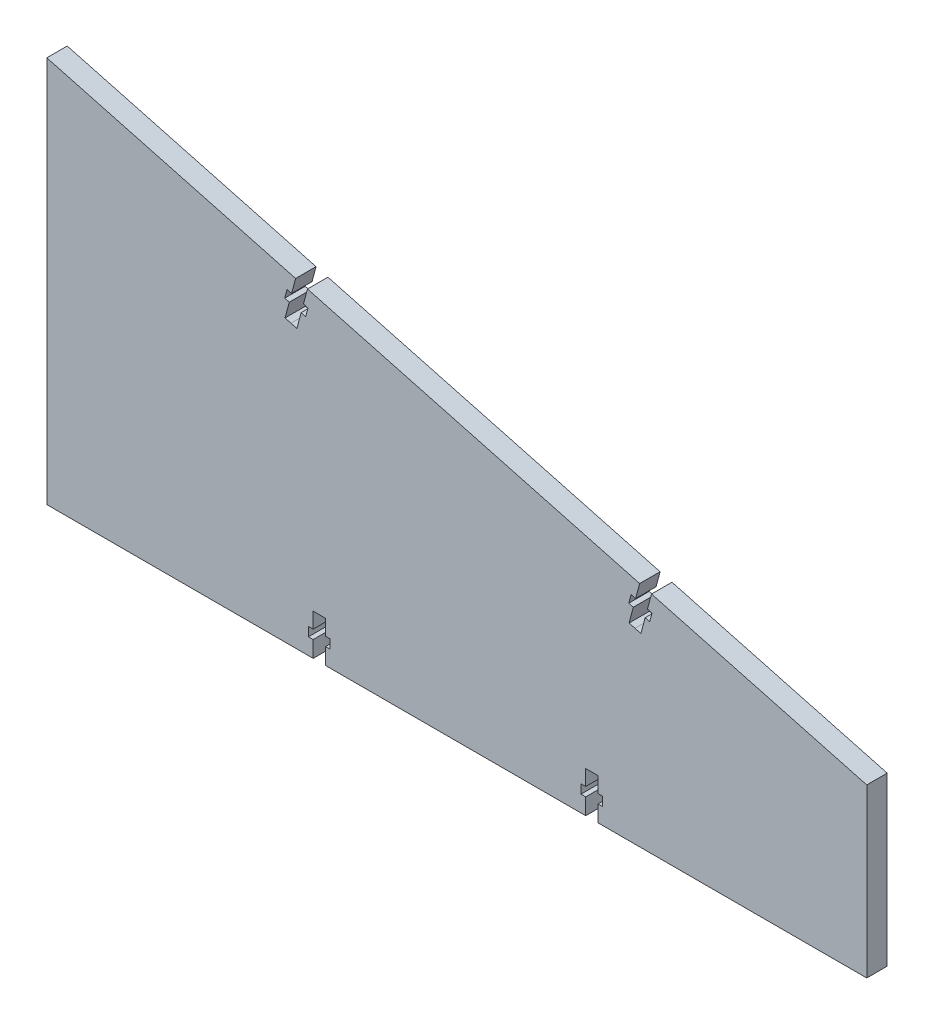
ISO-10303-21;
HEADER;
FILE_DESCRIPTION(('STEP AP214'),'2;1');
FILE_NAME('part.step','',(''),(''),'','','');
FILE_SCHEMA(('AUTOMOTIVE_DESIGN { 1 0 10303 214 1 1 1 1 }'));
ENDSEC;
DATA;
#1=APPLICATION_CONTEXT('core data for automotive mechanical design processes');
#2=APPLICATION_PROTOCOL_DEFINITION('international standard','automotive_design',2000,#1);
#3=PRODUCT_CONTEXT('',#1,'mechanical');
#4=PRODUCT('Part','Part','',(#3));
#5=PRODUCT_RELATED_PRODUCT_CATEGORY('part','',(#4));
#6=PRODUCT_DEFINITION_FORMATION('','',#4);
#7=PRODUCT_DEFINITION_CONTEXT('part definition',#1,'design');
#8=PRODUCT_DEFINITION('design','',#6,#7);
#9=PRODUCT_DEFINITION_SHAPE('','',#8);
#10=(LENGTH_UNIT() NAMED_UNIT(*) SI_UNIT(.MILLI.,.METRE.));
#11=(NAMED_UNIT(*) PLANE_ANGLE_UNIT() SI_UNIT($,.RADIAN.));
#12=(NAMED_UNIT(*) SI_UNIT($,.STERADIAN.) SOLID_ANGLE_UNIT());
#13=UNCERTAINTY_MEASURE_WITH_UNIT(LENGTH_MEASURE(1.E-05),#10,'distance_accuracy_value','');
#14=(GEOMETRIC_REPRESENTATION_CONTEXT(3) GLOBAL_UNCERTAINTY_ASSIGNED_CONTEXT((#13)) GLOBAL_UNIT_ASSIGNED_CONTEXT((#10,
#11,#12)) REPRESENTATION_CONTEXT('',''));
#15=CARTESIAN_POINT('',(0.,0.,0.));
#16=DIRECTION('',(0.,0.,1.));
#17=DIRECTION('',(1.,0.,0.));
#18=AXIS2_PLACEMENT_3D('',#15,#16,#17);
#19=CARTESIAN_POINT('',(9.52091741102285,-39.7791157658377,0.));
#20=DIRECTION('',(0.,-1.,0.));
#21=DIRECTION('',(0.,0.,-1.));
#22=AXIS2_PLACEMENT_3D('',#19,#20,#21);
#23=PLANE('',#22);
#24=DIRECTION('',(1.,0.,0.));
#25=VECTOR('',#24,1.);
#26=CARTESIAN_POINT('',(9.52091741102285,-39.7791157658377,5.));
#27=LINE('',#26,#25);
#28=CARTESIAN_POINT('',(9.52091741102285,-39.7791157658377,5.));
#29=VERTEX_POINT('',#28);
#30=CARTESIAN_POINT('',(10.6706103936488,-39.7791157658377,5.));
#31=VERTEX_POINT('',#30);
#32=EDGE_CURVE('E406',#29,#31,#27,.T.);
#33=ORIENTED_EDGE('',*,*,#32,.F.);
#34=DIRECTION('',(0.,0.,1.));
#35=VECTOR('',#34,1.);
#36=CARTESIAN_POINT('',(9.52091741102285,-39.7791157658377,0.));
#37=LINE('',#36,#35);
#38=CARTESIAN_POINT('',(9.52091741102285,-39.7791157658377,0.));
#39=VERTEX_POINT('',#38);
#40=EDGE_CURVE('E11',#39,#29,#37,.T.);
#41=ORIENTED_EDGE('',*,*,#40,.F.);
#42=DIRECTION('',(1.,0.,0.));
#43=VECTOR('',#42,1.);
#44=CARTESIAN_POINT('',(9.52091741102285,-39.7791157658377,0.));
#45=LINE('',#44,#43);
#46=CARTESIAN_POINT('',(10.6706103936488,-39.7791157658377,0.));
#47=VERTEX_POINT('',#46);
#48=EDGE_CURVE('E564',#39,#47,#45,.T.);
#49=ORIENTED_EDGE('',*,*,#48,.T.);
#50=DIRECTION('',(0.,0.,1.));
#51=VECTOR('',#50,1.);
#52=CARTESIAN_POINT('',(10.6706103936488,-39.7791157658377,0.));
#53=LINE('',#52,#51);
#54=EDGE_CURVE('E36',#47,#31,#53,.T.);
#55=ORIENTED_EDGE('',*,*,#54,.T.);
#56=EDGE_LOOP('',(#33,#41,#49,#55));
#57=FACE_BOUND('',#56,.T.);
#58=ADVANCED_FACE('F33',(#57),#23,.T.);
#59=CARTESIAN_POINT('',(9.52091741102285,-35.9801302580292,0.));
#60=DIRECTION('',(-1.,0.,0.));
#61=DIRECTION('',(0.,0.,1.));
#62=AXIS2_PLACEMENT_3D('',#59,#60,#61);
#63=PLANE('',#62);
#64=DIRECTION('',(0.,-1.,0.));
#65=VECTOR('',#64,1.);
#66=CARTESIAN_POINT('',(9.52091741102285,-35.9801302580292,5.));
#67=LINE('',#66,#65);
#68=CARTESIAN_POINT('',(9.52091741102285,-35.9801302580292,5.));
#69=VERTEX_POINT('',#68);
#70=EDGE_CURVE('E562',#69,#29,#67,.T.);
#71=ORIENTED_EDGE('',*,*,#70,.F.);
#72=DIRECTION('',(0.,0.,1.));
#73=VECTOR('',#72,1.);
#74=CARTESIAN_POINT('',(9.52091741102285,-35.9801302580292,0.));
#75=LINE('',#74,#73);
#76=CARTESIAN_POINT('',(9.52091741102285,-35.9801302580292,0.));
#77=VERTEX_POINT('',#76);
#78=EDGE_CURVE('E42',#77,#69,#75,.T.);
#79=ORIENTED_EDGE('',*,*,#78,.F.);
#80=DIRECTION('',(0.,-1.,0.));
#81=VECTOR('',#80,1.);
#82=CARTESIAN_POINT('',(9.52091741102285,-35.9801302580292,0.));
#83=LINE('',#82,#81);
#84=EDGE_CURVE('E396',#77,#39,#83,.T.);
#85=ORIENTED_EDGE('',*,*,#84,.T.);
#86=ORIENTED_EDGE('',*,*,#40,.T.);
#87=EDGE_LOOP('',(#71,#79,#85,#86));
#88=FACE_BOUND('',#87,.T.);
#89=ADVANCED_FACE('F668',(#88),#63,.T.);
#90=CARTESIAN_POINT('',(6.5217183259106,-35.9801302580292,0.));
#91=DIRECTION('',(0.,-1.,0.));
#92=DIRECTION('',(0.,0.,-1.));
#93=AXIS2_PLACEMENT_3D('',#90,#91,#92);
#94=PLANE('',#93);
#95=DIRECTION('',(1.,0.,0.));
#96=VECTOR('',#95,1.);
#97=CARTESIAN_POINT('',(6.5217183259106,-35.9801302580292,5.));
#98=LINE('',#97,#96);
#99=CARTESIAN_POINT('',(6.5217183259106,-35.9801302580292,5.));
#100=VERTEX_POINT('',#99);
#101=EDGE_CURVE('E383',#100,#69,#98,.T.);
#102=ORIENTED_EDGE('',*,*,#101,.F.);
#103=DIRECTION('',(0.,0.,1.));
#104=VECTOR('',#103,1.);
#105=CARTESIAN_POINT('',(6.5217183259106,-35.9801302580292,0.));
#106=LINE('',#105,#104);
#107=CARTESIAN_POINT('',(6.5217183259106,-35.9801302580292,0.));
#108=VERTEX_POINT('',#107);
#109=EDGE_CURVE('E378',#108,#100,#106,.T.);
#110=ORIENTED_EDGE('',*,*,#109,.F.);
#111=DIRECTION('',(1.,0.,0.));
#112=VECTOR('',#111,1.);
#113=CARTESIAN_POINT('',(6.5217183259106,-35.9801302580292,0.));
#114=LINE('',#113,#112);
#115=EDGE_CURVE('E381',#108,#77,#114,.T.);
#116=ORIENTED_EDGE('',*,*,#115,.T.);
#117=ORIENTED_EDGE('',*,*,#78,.T.);
#118=EDGE_LOOP('',(#102,#110,#116,#117));
#119=FACE_BOUND('',#118,.T.);
#120=ADVANCED_FACE('F380',(#119),#94,.T.);
#121=CARTESIAN_POINT('',(6.5217183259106,-39.7791157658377,0.));
#122=DIRECTION('',(1.,0.,0.));
#123=DIRECTION('',(0.,0.,-1.));
#124=AXIS2_PLACEMENT_3D('',#121,#122,#123);
#125=PLANE('',#124);
#126=DIRECTION('',(0.,1.,0.));
#127=VECTOR('',#126,1.);
#128=CARTESIAN_POINT('',(6.5217183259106,-39.7791157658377,5.));
#129=LINE('',#128,#127);
#130=CARTESIAN_POINT('',(6.5217183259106,-39.7791157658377,5.));
#131=VERTEX_POINT('',#130);
#132=EDGE_CURVE('E559',#131,#100,#129,.T.);
#133=ORIENTED_EDGE('',*,*,#132,.F.);
#134=DIRECTION('',(0.,0.,1.));
#135=VECTOR('',#134,1.);
#136=CARTESIAN_POINT('',(6.5217183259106,-39.7791157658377,0.));
#137=LINE('',#136,#135);
#138=CARTESIAN_POINT('',(6.5217183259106,-39.7791157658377,0.));
#139=VERTEX_POINT('',#138);
#140=EDGE_CURVE('E388',#139,#131,#137,.T.);
#141=ORIENTED_EDGE('',*,*,#140,.F.);
#142=DIRECTION('',(0.,1.,0.));
#143=VECTOR('',#142,1.);
#144=CARTESIAN_POINT('',(6.5217183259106,-39.7791157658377,0.));
#145=LINE('',#144,#143);
#146=EDGE_CURVE('E394',#139,#108,#145,.T.);
#147=ORIENTED_EDGE('',*,*,#146,.T.);
#148=ORIENTED_EDGE('',*,*,#109,.T.);
#149=EDGE_LOOP('',(#133,#141,#147,#148));
#150=FACE_BOUND('',#149,.T.);
#151=ADVANCED_FACE('F398',(#150),#125,.T.);
#152=CARTESIAN_POINT('',(5.37202534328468,-39.7791157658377,0.));
#153=DIRECTION('',(0.,-1.,0.));
#154=DIRECTION('',(0.,0.,-1.));
#155=AXIS2_PLACEMENT_3D('',#152,#153,#154);
#156=PLANE('',#155);
#157=DIRECTION('',(1.,0.,0.));
#158=VECTOR('',#157,1.);
#159=CARTESIAN_POINT('',(5.37202534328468,-39.7791157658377,5.));
#160=LINE('',#159,#158);
#161=CARTESIAN_POINT('',(5.37202534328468,-39.7791157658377,5.));
#162=VERTEX_POINT('',#161);
#163=EDGE_CURVE('E556',#162,#131,#160,.T.);
#164=ORIENTED_EDGE('',*,*,#163,.F.);
#165=DIRECTION('',(0.,0.,1.));
#166=VECTOR('',#165,1.);
#167=CARTESIAN_POINT('',(5.37202534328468,-39.7791157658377,0.));
#168=LINE('',#167,#166);
#169=CARTESIAN_POINT('',(5.37202534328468,-39.7791157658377,0.));
#170=VERTEX_POINT('',#169);
#171=EDGE_CURVE('E568',#170,#162,#168,.T.);
#172=ORIENTED_EDGE('',*,*,#171,.F.);
#173=DIRECTION('',(1.,0.,0.));
#174=VECTOR('',#173,1.);
#175=CARTESIAN_POINT('',(5.37202534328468,-39.7791157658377,0.));
#176=LINE('',#175,#174);
#177=EDGE_CURVE('E399',#170,#139,#176,.T.);
#178=ORIENTED_EDGE('',*,*,#177,.T.);
#179=ORIENTED_EDGE('',*,*,#140,.T.);
#180=EDGE_LOOP('',(#164,#172,#178,#179));
#181=FACE_BOUND('',#180,.T.);
#182=ADVANCED_FACE('F681',(#181),#156,.T.);
#183=CARTESIAN_POINT('',(5.37202534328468,-41.978528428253,0.));
#184=DIRECTION('',(1.,0.,0.));
#185=DIRECTION('',(0.,0.,-1.));
#186=AXIS2_PLACEMENT_3D('',#183,#184,#185);
#187=PLANE('',#186);
#188=DIRECTION('',(0.,1.,0.));
#189=VECTOR('',#188,1.);
#190=CARTESIAN_POINT('',(5.37202534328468,-41.978528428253,5.));
#191=LINE('',#190,#189);
#192=CARTESIAN_POINT('',(5.37202534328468,-41.978528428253,5.));
#193=VERTEX_POINT('',#192);
#194=EDGE_CURVE('E553',#193,#162,#191,.T.);
#195=ORIENTED_EDGE('',*,*,#194,.F.);
#196=DIRECTION('',(0.,0.,1.));
#197=VECTOR('',#196,1.);
#198=CARTESIAN_POINT('',(5.37202534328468,-41.978528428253,0.));
#199=LINE('',#198,#197);
#200=CARTESIAN_POINT('',(5.37202534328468,-41.978528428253,0.));
#201=VERTEX_POINT('',#200);
#202=EDGE_CURVE('E570',#201,#193,#199,.T.);
#203=ORIENTED_EDGE('',*,*,#202,.F.);
#204=DIRECTION('',(0.,1.,0.));
#205=VECTOR('',#204,1.);
#206=CARTESIAN_POINT('',(5.37202534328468,-41.978528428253,0.));
#207=LINE('',#206,#205);
#208=EDGE_CURVE('E401',#201,#170,#207,.T.);
#209=ORIENTED_EDGE('',*,*,#208,.T.);
#210=ORIENTED_EDGE('',*,*,#171,.T.);
#211=EDGE_LOOP('',(#195,#203,#209,#210));
#212=FACE_BOUND('',#211,.T.);
#213=ADVANCED_FACE('F684',(#212),#187,.T.);
#214=CARTESIAN_POINT('',(6.52171832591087,-41.978528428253,0.));
#215=DIRECTION('',(0.,1.,0.));
#216=DIRECTION('',(-1.,0.,0.));
#217=AXIS2_PLACEMENT_3D('',#214,#215,#216);
#218=PLANE('',#217);
#219=DIRECTION('',(-1.,0.,0.));
#220=VECTOR('',#219,1.);
#221=CARTESIAN_POINT('',(6.52171832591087,-41.978528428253,5.));
#222=LINE('',#221,#220);
#223=CARTESIAN_POINT('',(6.52171832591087,-41.978528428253,5.));
#224=VERTEX_POINT('',#223);
#225=EDGE_CURVE('E550',#224,#193,#222,.T.);
#226=ORIENTED_EDGE('',*,*,#225,.F.);
#227=DIRECTION('',(0.,0.,1.));
#228=VECTOR('',#227,1.);
#229=CARTESIAN_POINT('',(6.52171832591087,-41.978528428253,0.));
#230=LINE('',#229,#228);
#231=CARTESIAN_POINT('',(6.52171832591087,-41.978528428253,0.));
#232=VERTEX_POINT('',#231);
#233=EDGE_CURVE('E572',#232,#224,#230,.T.);
#234=ORIENTED_EDGE('',*,*,#233,.F.);
#235=DIRECTION('',(-1.,0.,0.));
#236=VECTOR('',#235,1.);
#237=CARTESIAN_POINT('',(6.52171832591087,-41.978528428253,0.));
#238=LINE('',#237,#236);
#239=EDGE_CURVE('E1384',#232,#201,#238,.T.);
#240=ORIENTED_EDGE('',*,*,#239,.T.);
#241=ORIENTED_EDGE('',*,*,#202,.T.);
#242=EDGE_LOOP('',(#226,#234,#240,#241));
#243=FACE_BOUND('',#242,.T.);
#244=ADVANCED_FACE('F688',(#243),#218,.T.);
#245=CARTESIAN_POINT('',(6.52171832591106,-45.9774605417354,0.));
#246=DIRECTION('',(1.,0.,0.));
#247=DIRECTION('',(0.,1.,0.));
#248=AXIS2_PLACEMENT_3D('',#245,#246,#247);
#249=PLANE('',#248);
#250=DIRECTION('',(0.,1.,0.));
#251=VECTOR('',#250,1.);
#252=CARTESIAN_POINT('',(6.52171832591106,-45.9774605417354,5.));
#253=LINE('',#252,#251);
#254=CARTESIAN_POINT('',(6.52171832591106,-45.9774605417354,5.));
#255=VERTEX_POINT('',#254);
#256=EDGE_CURVE('E547',#255,#224,#253,.T.);
#257=ORIENTED_EDGE('',*,*,#256,.F.);
#258=DIRECTION('',(0.,0.,1.));
#259=VECTOR('',#258,1.);
#260=CARTESIAN_POINT('',(6.52171832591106,-45.9774605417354,0.));
#261=LINE('',#260,#259);
#262=CARTESIAN_POINT('',(6.52171832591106,-45.9774605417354,0.));
#263=VERTEX_POINT('',#262);
#264=EDGE_CURVE('E574',#263,#255,#261,.T.);
#265=ORIENTED_EDGE('',*,*,#264,.F.);
#266=DIRECTION('',(0.,1.,0.));
#267=VECTOR('',#266,1.);
#268=CARTESIAN_POINT('',(6.52171832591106,-45.9774605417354,0.));
#269=LINE('',#268,#267);
#270=EDGE_CURVE('E1388',#263,#232,#269,.T.);
#271=ORIENTED_EDGE('',*,*,#270,.T.);
#272=ORIENTED_EDGE('',*,*,#233,.T.);
#273=EDGE_LOOP('',(#257,#265,#271,#272));
#274=FACE_BOUND('',#273,.T.);
#275=ADVANCED_FACE('F692',(#274),#249,.T.);
#276=CARTESIAN_POINT('',(-57.1279511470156,-45.9774605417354,0.));
#277=DIRECTION('',(0.,-1.,0.));
#278=DIRECTION('',(0.,0.,-1.));
#279=AXIS2_PLACEMENT_3D('',#276,#277,#278);
#280=PLANE('',#279);
#281=DIRECTION('',(1.,0.,0.));
#282=VECTOR('',#281,1.);
#283=CARTESIAN_POINT('',(-57.1279511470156,-45.9774605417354,5.));
#284=LINE('',#283,#282);
#285=CARTESIAN_POINT('',(-57.1279511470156,-45.9774605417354,5.));
#286=VERTEX_POINT('',#285);
#287=EDGE_CURVE('E544',#286,#255,#284,.T.);
#288=ORIENTED_EDGE('',*,*,#287,.F.);
#289=DIRECTION('',(0.,0.,1.));
#290=VECTOR('',#289,1.);
#291=CARTESIAN_POINT('',(-57.1279511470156,-45.9774605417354,0.));
#292=LINE('',#291,#290);
#293=CARTESIAN_POINT('',(-57.1279511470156,-45.9774605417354,0.));
#294=VERTEX_POINT('',#293);
#295=EDGE_CURVE('E576',#294,#286,#292,.T.);
#296=ORIENTED_EDGE('',*,*,#295,.F.);
#297=DIRECTION('',(1.,0.,0.));
#298=VECTOR('',#297,1.);
#299=CARTESIAN_POINT('',(-57.1279511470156,-45.9774605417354,0.));
#300=LINE('',#299,#298);
#301=EDGE_CURVE('E1377',#294,#263,#300,.T.);
#302=ORIENTED_EDGE('',*,*,#301,.T.);
#303=ORIENTED_EDGE('',*,*,#264,.T.);
#304=EDGE_LOOP('',(#288,#296,#302,#303));
#305=FACE_BOUND('',#304,.T.);
#306=ADVANCED_FACE('F696',(#305),#280,.T.);
#307=CARTESIAN_POINT('',(-57.1279511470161,-41.978528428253,0.));
#308=DIRECTION('',(-1.,-1.23198257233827E-13,0.));
#309=DIRECTION('',(1.23198257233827E-13,-1.,0.));
#310=AXIS2_PLACEMENT_3D('',#307,#308,#309);
#311=PLANE('',#310);
#312=DIRECTION('',(1.23198257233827E-13,-1.,0.));
#313=VECTOR('',#312,1.);
#314=CARTESIAN_POINT('',(-57.1279511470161,-41.978528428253,5.));
#315=LINE('',#314,#313);
#316=CARTESIAN_POINT('',(-57.1279511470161,-41.978528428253,5.));
#317=VERTEX_POINT('',#316);
#318=EDGE_CURVE('E541',#317,#286,#315,.T.);
#319=ORIENTED_EDGE('',*,*,#318,.F.);
#320=DIRECTION('',(0.,0.,1.));
#321=VECTOR('',#320,1.);
#322=CARTESIAN_POINT('',(-57.1279511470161,-41.978528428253,0.));
#323=LINE('',#322,#321);
#324=CARTESIAN_POINT('',(-57.1279511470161,-41.978528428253,0.));
#325=VERTEX_POINT('',#324);
#326=EDGE_CURVE('E578',#325,#317,#323,.T.);
#327=ORIENTED_EDGE('',*,*,#326,.F.);
#328=DIRECTION('',(1.23198257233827E-13,-1.,0.));
#329=VECTOR('',#328,1.);
#330=CARTESIAN_POINT('',(-57.1279511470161,-41.978528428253,0.));
#331=LINE('',#330,#329);
#332=EDGE_CURVE('E1373',#325,#294,#331,.T.);
#333=ORIENTED_EDGE('',*,*,#332,.T.);
#334=ORIENTED_EDGE('',*,*,#295,.T.);
#335=EDGE_LOOP('',(#319,#327,#333,#334));
#336=FACE_BOUND('',#335,.T.);
#337=ADVANCED_FACE('F700',(#336),#311,.T.);
#338=CARTESIAN_POINT('',(-55.97825816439,-41.978528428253,0.));
#339=DIRECTION('',(0.,1.,0.));
#340=DIRECTION('',(-1.,0.,0.));
#341=AXIS2_PLACEMENT_3D('',#338,#339,#340);
#342=PLANE('',#341);
#343=DIRECTION('',(-1.,0.,0.));
#344=VECTOR('',#343,1.);
#345=CARTESIAN_POINT('',(-55.97825816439,-41.978528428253,5.));
#346=LINE('',#345,#344);
#347=CARTESIAN_POINT('',(-55.97825816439,-41.978528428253,5.));
#348=VERTEX_POINT('',#347);
#349=EDGE_CURVE('E538',#348,#317,#346,.T.);
#350=ORIENTED_EDGE('',*,*,#349,.F.);
#351=DIRECTION('',(0.,0.,1.));
#352=VECTOR('',#351,1.);
#353=CARTESIAN_POINT('',(-55.97825816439,-41.978528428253,0.));
#354=LINE('',#353,#352);
#355=CARTESIAN_POINT('',(-55.97825816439,-41.978528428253,0.));
#356=VERTEX_POINT('',#355);
#357=EDGE_CURVE('E580',#356,#348,#354,.T.);
#358=ORIENTED_EDGE('',*,*,#357,.F.);
#359=DIRECTION('',(-1.,0.,0.));
#360=VECTOR('',#359,1.);
#361=CARTESIAN_POINT('',(-55.97825816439,-41.978528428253,0.));
#362=LINE('',#361,#360);
#363=EDGE_CURVE('E1394',#356,#325,#362,.T.);
#364=ORIENTED_EDGE('',*,*,#363,.T.);
#365=ORIENTED_EDGE('',*,*,#326,.T.);
#366=EDGE_LOOP('',(#350,#358,#364,#365));
#367=FACE_BOUND('',#366,.T.);
#368=ADVANCED_FACE('F704',(#367),#342,.T.);
#369=CARTESIAN_POINT('',(-55.97825816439,-39.7791157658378,0.));
#370=DIRECTION('',(-1.,0.,0.));
#371=DIRECTION('',(0.,0.,1.));
#372=AXIS2_PLACEMENT_3D('',#369,#370,#371);
#373=PLANE('',#372);
#374=DIRECTION('',(0.,-1.,0.));
#375=VECTOR('',#374,1.);
#376=CARTESIAN_POINT('',(-55.97825816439,-39.7791157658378,5.));
#377=LINE('',#376,#375);
#378=CARTESIAN_POINT('',(-55.97825816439,-39.7791157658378,5.));
#379=VERTEX_POINT('',#378);
#380=EDGE_CURVE('E535',#379,#348,#377,.T.);
#381=ORIENTED_EDGE('',*,*,#380,.F.);
#382=DIRECTION('',(0.,0.,1.));
#383=VECTOR('',#382,1.);
#384=CARTESIAN_POINT('',(-55.97825816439,-39.7791157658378,0.));
#385=LINE('',#384,#383);
#386=CARTESIAN_POINT('',(-55.97825816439,-39.7791157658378,0.));
#387=VERTEX_POINT('',#386);
#388=EDGE_CURVE('E582',#387,#379,#385,.T.);
#389=ORIENTED_EDGE('',*,*,#388,.F.);
#390=DIRECTION('',(0.,-1.,0.));
#391=VECTOR('',#390,1.);
#392=CARTESIAN_POINT('',(-55.97825816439,-39.7791157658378,0.));
#393=LINE('',#392,#391);
#394=EDGE_CURVE('E1366',#387,#356,#393,.T.);
#395=ORIENTED_EDGE('',*,*,#394,.T.);
#396=ORIENTED_EDGE('',*,*,#357,.T.);
#397=EDGE_LOOP('',(#381,#389,#395,#396));
#398=FACE_BOUND('',#397,.T.);
#399=ADVANCED_FACE('F708',(#398),#373,.T.);
#400=CARTESIAN_POINT('',(-57.1279511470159,-39.7791157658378,0.));
#401=DIRECTION('',(0.,-1.,0.));
#402=DIRECTION('',(1.,0.,0.));
#403=AXIS2_PLACEMENT_3D('',#400,#401,#402);
#404=PLANE('',#403);
#405=DIRECTION('',(1.,0.,0.));
#406=VECTOR('',#405,1.);
#407=CARTESIAN_POINT('',(-57.1279511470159,-39.7791157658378,5.));
#408=LINE('',#407,#406);
#409=CARTESIAN_POINT('',(-57.1279511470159,-39.7791157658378,5.));
#410=VERTEX_POINT('',#409);
#411=EDGE_CURVE('E532',#410,#379,#408,.T.);
#412=ORIENTED_EDGE('',*,*,#411,.F.);
#413=DIRECTION('',(0.,0.,1.));
#414=VECTOR('',#413,1.);
#415=CARTESIAN_POINT('',(-57.1279511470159,-39.7791157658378,0.));
#416=LINE('',#415,#414);
#417=CARTESIAN_POINT('',(-57.1279511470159,-39.7791157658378,0.));
#418=VERTEX_POINT('',#417);
#419=EDGE_CURVE('E584',#418,#410,#416,.T.);
#420=ORIENTED_EDGE('',*,*,#419,.F.);
#421=DIRECTION('',(1.,0.,0.));
#422=VECTOR('',#421,1.);
#423=CARTESIAN_POINT('',(-57.1279511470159,-39.7791157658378,0.));
#424=LINE('',#423,#422);
#425=EDGE_CURVE('E1362',#418,#387,#424,.T.);
#426=ORIENTED_EDGE('',*,*,#425,.T.);
#427=ORIENTED_EDGE('',*,*,#388,.T.);
#428=EDGE_LOOP('',(#412,#420,#426,#427));
#429=FACE_BOUND('',#428,.T.);
#430=ADVANCED_FACE('F712',(#429),#404,.T.);
#431=CARTESIAN_POINT('',(-57.1279511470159,-35.9801302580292,0.));
#432=DIRECTION('',(-1.,0.,0.));
#433=DIRECTION('',(0.,0.,1.));
#434=AXIS2_PLACEMENT_3D('',#431,#432,#433);
#435=PLANE('',#434);
#436=DIRECTION('',(0.,-1.,0.));
#437=VECTOR('',#436,1.);
#438=CARTESIAN_POINT('',(-57.1279511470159,-35.9801302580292,5.));
#439=LINE('',#438,#437);
#440=CARTESIAN_POINT('',(-57.1279511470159,-35.9801302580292,5.));
#441=VERTEX_POINT('',#440);
#442=EDGE_CURVE('E529',#441,#410,#439,.T.);
#443=ORIENTED_EDGE('',*,*,#442,.F.);
#444=DIRECTION('',(0.,0.,1.));
#445=VECTOR('',#444,1.);
#446=CARTESIAN_POINT('',(-57.1279511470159,-35.9801302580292,0.));
#447=LINE('',#446,#445);
#448=CARTESIAN_POINT('',(-57.1279511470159,-35.9801302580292,0.));
#449=VERTEX_POINT('',#448);
#450=EDGE_CURVE('E586',#449,#441,#447,.T.);
#451=ORIENTED_EDGE('',*,*,#450,.F.);
#452=DIRECTION('',(0.,-1.,0.));
#453=VECTOR('',#452,1.);
#454=CARTESIAN_POINT('',(-57.1279511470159,-35.9801302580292,0.));
#455=LINE('',#454,#453);
#456=EDGE_CURVE('E1398',#449,#418,#455,.T.);
#457=ORIENTED_EDGE('',*,*,#456,.T.);
#458=ORIENTED_EDGE('',*,*,#419,.T.);
#459=EDGE_LOOP('',(#443,#451,#457,#458));
#460=FACE_BOUND('',#459,.T.);
#461=ADVANCED_FACE('F716',(#460),#435,.T.);
#462=CARTESIAN_POINT('',(-60.1271502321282,-35.9801302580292,0.));
#463=DIRECTION('',(0.,-1.,0.));
#464=DIRECTION('',(0.,0.,-1.));
#465=AXIS2_PLACEMENT_3D('',#462,#463,#464);
#466=PLANE('',#465);
#467=DIRECTION('',(1.,0.,0.));
#468=VECTOR('',#467,1.);
#469=CARTESIAN_POINT('',(-60.1271502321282,-35.9801302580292,5.));
#470=LINE('',#469,#468);
#471=CARTESIAN_POINT('',(-60.1271502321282,-35.9801302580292,5.));
#472=VERTEX_POINT('',#471);
#473=EDGE_CURVE('E526',#472,#441,#470,.T.);
#474=ORIENTED_EDGE('',*,*,#473,.F.);
#475=DIRECTION('',(0.,0.,1.));
#476=VECTOR('',#475,1.);
#477=CARTESIAN_POINT('',(-60.1271502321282,-35.9801302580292,0.));
#478=LINE('',#477,#476);
#479=CARTESIAN_POINT('',(-60.1271502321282,-35.9801302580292,0.));
#480=VERTEX_POINT('',#479);
#481=EDGE_CURVE('E588',#480,#472,#478,.T.);
#482=ORIENTED_EDGE('',*,*,#481,.F.);
#483=DIRECTION('',(1.,0.,0.));
#484=VECTOR('',#483,1.);
#485=CARTESIAN_POINT('',(-60.1271502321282,-35.9801302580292,0.));
#486=LINE('',#485,#484);
#487=EDGE_CURVE('E1355',#480,#449,#486,.T.);
#488=ORIENTED_EDGE('',*,*,#487,.T.);
#489=ORIENTED_EDGE('',*,*,#450,.T.);
#490=EDGE_LOOP('',(#474,#482,#488,#489));
#491=FACE_BOUND('',#490,.T.);
#492=ADVANCED_FACE('F720',(#491),#466,.T.);
#493=CARTESIAN_POINT('',(-60.1271502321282,-39.7791157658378,0.));
#494=DIRECTION('',(1.,0.,0.));
#495=DIRECTION('',(0.,0.,-1.));
#496=AXIS2_PLACEMENT_3D('',#493,#494,#495);
#497=PLANE('',#496);
#498=DIRECTION('',(0.,1.,0.));
#499=VECTOR('',#498,1.);
#500=CARTESIAN_POINT('',(-60.1271502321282,-39.7791157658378,5.));
#501=LINE('',#500,#499);
#502=CARTESIAN_POINT('',(-60.1271502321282,-39.7791157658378,5.));
#503=VERTEX_POINT('',#502);
#504=EDGE_CURVE('E523',#503,#472,#501,.T.);
#505=ORIENTED_EDGE('',*,*,#504,.F.);
#506=DIRECTION('',(0.,0.,1.));
#507=VECTOR('',#506,1.);
#508=CARTESIAN_POINT('',(-60.1271502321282,-39.7791157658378,0.));
#509=LINE('',#508,#507);
#510=CARTESIAN_POINT('',(-60.1271502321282,-39.7791157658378,0.));
#511=VERTEX_POINT('',#510);
#512=EDGE_CURVE('E590',#511,#503,#509,.T.);
#513=ORIENTED_EDGE('',*,*,#512,.F.);
#514=DIRECTION('',(0.,1.,0.));
#515=VECTOR('',#514,1.);
#516=CARTESIAN_POINT('',(-60.1271502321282,-39.7791157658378,0.));
#517=LINE('',#516,#515);
#518=EDGE_CURVE('E1351',#511,#480,#517,.T.);
#519=ORIENTED_EDGE('',*,*,#518,.T.);
#520=ORIENTED_EDGE('',*,*,#481,.T.);
#521=EDGE_LOOP('',(#505,#513,#519,#520));
#522=FACE_BOUND('',#521,.T.);
#523=ADVANCED_FACE('F724',(#522),#497,.T.);
#524=CARTESIAN_POINT('',(-61.2768432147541,-39.7791157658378,0.));
#525=DIRECTION('',(0.,-1.,0.));
#526=DIRECTION('',(0.,0.,-1.));
#527=AXIS2_PLACEMENT_3D('',#524,#525,#526);
#528=PLANE('',#527);
#529=DIRECTION('',(1.,0.,0.));
#530=VECTOR('',#529,1.);
#531=CARTESIAN_POINT('',(-61.2768432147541,-39.7791157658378,5.));
#532=LINE('',#531,#530);
#533=CARTESIAN_POINT('',(-61.2768432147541,-39.7791157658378,5.));
#534=VERTEX_POINT('',#533);
#535=EDGE_CURVE('E520',#534,#503,#532,.T.);
#536=ORIENTED_EDGE('',*,*,#535,.F.);
#537=DIRECTION('',(0.,0.,1.));
#538=VECTOR('',#537,1.);
#539=CARTESIAN_POINT('',(-61.2768432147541,-39.7791157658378,0.));
#540=LINE('',#539,#538);
#541=CARTESIAN_POINT('',(-61.2768432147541,-39.7791157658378,0.));
#542=VERTEX_POINT('',#541);
#543=EDGE_CURVE('E592',#542,#534,#540,.T.);
#544=ORIENTED_EDGE('',*,*,#543,.F.);
#545=DIRECTION('',(1.,0.,0.));
#546=VECTOR('',#545,1.);
#547=CARTESIAN_POINT('',(-61.2768432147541,-39.7791157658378,0.));
#548=LINE('',#547,#546);
#549=EDGE_CURVE('E1402',#542,#511,#548,.T.);
#550=ORIENTED_EDGE('',*,*,#549,.T.);
#551=ORIENTED_EDGE('',*,*,#512,.T.);
#552=EDGE_LOOP('',(#536,#544,#550,#551));
#553=FACE_BOUND('',#552,.T.);
#554=ADVANCED_FACE('F728',(#553),#528,.T.);
#555=CARTESIAN_POINT('',(-61.2768432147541,-41.978528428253,0.));
#556=DIRECTION('',(1.,0.,0.));
#557=DIRECTION('',(0.,0.,-1.));
#558=AXIS2_PLACEMENT_3D('',#555,#556,#557);
#559=PLANE('',#558);
#560=DIRECTION('',(0.,1.,0.));
#561=VECTOR('',#560,1.);
#562=CARTESIAN_POINT('',(-61.2768432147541,-41.978528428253,5.));
#563=LINE('',#562,#561);
#564=CARTESIAN_POINT('',(-61.2768432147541,-41.978528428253,5.));
#565=VERTEX_POINT('',#564);
#566=EDGE_CURVE('E517',#565,#534,#563,.T.);
#567=ORIENTED_EDGE('',*,*,#566,.F.);
#568=DIRECTION('',(0.,0.,1.));
#569=VECTOR('',#568,1.);
#570=CARTESIAN_POINT('',(-61.2768432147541,-41.978528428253,0.));
#571=LINE('',#570,#569);
#572=CARTESIAN_POINT('',(-61.2768432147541,-41.978528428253,0.));
#573=VERTEX_POINT('',#572);
#574=EDGE_CURVE('E594',#573,#565,#571,.T.);
#575=ORIENTED_EDGE('',*,*,#574,.F.);
#576=DIRECTION('',(0.,1.,0.));
#577=VECTOR('',#576,1.);
#578=CARTESIAN_POINT('',(-61.2768432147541,-41.978528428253,0.));
#579=LINE('',#578,#577);
#580=EDGE_CURVE('E1344',#573,#542,#579,.T.);
#581=ORIENTED_EDGE('',*,*,#580,.T.);
#582=ORIENTED_EDGE('',*,*,#543,.T.);
#583=EDGE_LOOP('',(#567,#575,#581,#582));
#584=FACE_BOUND('',#583,.T.);
#585=ADVANCED_FACE('F732',(#584),#559,.T.);
#586=CARTESIAN_POINT('',(-60.1271502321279,-41.978528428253,0.));
#587=DIRECTION('',(0.,1.,0.));
#588=DIRECTION('',(-1.,0.,0.));
#589=AXIS2_PLACEMENT_3D('',#586,#587,#588);
#590=PLANE('',#589);
#591=DIRECTION('',(-1.,0.,0.));
#592=VECTOR('',#591,1.);
#593=CARTESIAN_POINT('',(-60.1271502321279,-41.978528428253,5.));
#594=LINE('',#593,#592);
#595=CARTESIAN_POINT('',(-60.1271502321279,-41.978528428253,5.));
#596=VERTEX_POINT('',#595);
#597=EDGE_CURVE('E514',#596,#565,#594,.T.);
#598=ORIENTED_EDGE('',*,*,#597,.F.);
#599=DIRECTION('',(0.,0.,1.));
#600=VECTOR('',#599,1.);
#601=CARTESIAN_POINT('',(-60.1271502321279,-41.978528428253,0.));
#602=LINE('',#601,#600);
#603=CARTESIAN_POINT('',(-60.1271502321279,-41.978528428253,0.));
#604=VERTEX_POINT('',#603);
#605=EDGE_CURVE('E596',#604,#596,#602,.T.);
#606=ORIENTED_EDGE('',*,*,#605,.F.);
#607=DIRECTION('',(-1.,0.,0.));
#608=VECTOR('',#607,1.);
#609=CARTESIAN_POINT('',(-60.1271502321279,-41.978528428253,0.));
#610=LINE('',#609,#608);
#611=EDGE_CURVE('E1340',#604,#573,#610,.T.);
#612=ORIENTED_EDGE('',*,*,#611,.T.);
#613=ORIENTED_EDGE('',*,*,#574,.T.);
#614=EDGE_LOOP('',(#598,#606,#612,#613));
#615=FACE_BOUND('',#614,.T.);
#616=ADVANCED_FACE('F736',(#615),#590,.T.);
#617=CARTESIAN_POINT('',(-60.1271502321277,-45.9774605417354,0.));
#618=DIRECTION('',(1.,0.,0.));
#619=DIRECTION('',(0.,1.,0.));
#620=AXIS2_PLACEMENT_3D('',#617,#618,#619);
#621=PLANE('',#620);
#622=DIRECTION('',(0.,1.,0.));
#623=VECTOR('',#622,1.);
#624=CARTESIAN_POINT('',(-60.1271502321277,-45.9774605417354,5.));
#625=LINE('',#624,#623);
#626=CARTESIAN_POINT('',(-60.1271502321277,-45.9774605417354,5.));
#627=VERTEX_POINT('',#626);
#628=EDGE_CURVE('E511',#627,#596,#625,.T.);
#629=ORIENTED_EDGE('',*,*,#628,.F.);
#630=DIRECTION('',(0.,0.,1.));
#631=VECTOR('',#630,1.);
#632=CARTESIAN_POINT('',(-60.1271502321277,-45.9774605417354,0.));
#633=LINE('',#632,#631);
#634=CARTESIAN_POINT('',(-60.1271502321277,-45.9774605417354,0.));
#635=VERTEX_POINT('',#634);
#636=EDGE_CURVE('E598',#635,#627,#633,.T.);
#637=ORIENTED_EDGE('',*,*,#636,.F.);
#638=DIRECTION('',(0.,1.,0.));
#639=VECTOR('',#638,1.);
#640=CARTESIAN_POINT('',(-60.1271502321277,-45.9774605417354,0.));
#641=LINE('',#640,#639);
#642=EDGE_CURVE('E1406',#635,#604,#641,.T.);
#643=ORIENTED_EDGE('',*,*,#642,.T.);
#644=ORIENTED_EDGE('',*,*,#605,.T.);
#645=EDGE_LOOP('',(#629,#637,#643,#644));
#646=FACE_BOUND('',#645,.T.);
#647=ADVANCED_FACE('F740',(#646),#621,.T.);
#648=CARTESIAN_POINT('',(-125.27641924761,-45.9774605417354,0.));
#649=DIRECTION('',(0.,-1.,0.));
#650=DIRECTION('',(0.,0.,-1.));
#651=AXIS2_PLACEMENT_3D('',#648,#649,#650);
#652=PLANE('',#651);
#653=DIRECTION('',(1.,0.,0.));
#654=VECTOR('',#653,1.);
#655=CARTESIAN_POINT('',(-125.27641924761,-45.9774605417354,5.));
#656=LINE('',#655,#654);
#657=CARTESIAN_POINT('',(-125.27641924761,-45.9774605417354,5.));
#658=VERTEX_POINT('',#657);
#659=EDGE_CURVE('E508',#658,#627,#656,.T.);
#660=ORIENTED_EDGE('',*,*,#659,.F.);
#661=DIRECTION('',(0.,0.,1.));
#662=VECTOR('',#661,1.);
#663=CARTESIAN_POINT('',(-125.27641924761,-45.9774605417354,0.));
#664=LINE('',#663,#662);
#665=CARTESIAN_POINT('',(-125.27641924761,-45.9774605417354,0.));
#666=VERTEX_POINT('',#665);
#667=EDGE_CURVE('E600',#666,#658,#664,.T.);
#668=ORIENTED_EDGE('',*,*,#667,.F.);
#669=DIRECTION('',(1.,0.,0.));
#670=VECTOR('',#669,1.);
#671=CARTESIAN_POINT('',(-125.27641924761,-45.9774605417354,0.));
#672=LINE('',#671,#670);
#673=EDGE_CURVE('E1333',#666,#635,#672,.T.);
#674=ORIENTED_EDGE('',*,*,#673,.T.);
#675=ORIENTED_EDGE('',*,*,#636,.T.);
#676=EDGE_LOOP('',(#660,#668,#674,#675));
#677=FACE_BOUND('',#676,.T.);
#678=ADVANCED_FACE('F744',(#677),#652,.T.);
#679=CARTESIAN_POINT('',(-125.27641924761,48.6472705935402,0.));
#680=DIRECTION('',(-1.,0.,0.));
#681=DIRECTION('',(0.,0.,1.));
#682=AXIS2_PLACEMENT_3D('',#679,#680,#681);
#683=PLANE('',#682);
#684=DIRECTION('',(0.,-1.,0.));
#685=VECTOR('',#684,1.);
#686=CARTESIAN_POINT('',(-125.27641924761,48.6472705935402,5.));
#687=LINE('',#686,#685);
#688=CARTESIAN_POINT('',(-125.27641924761,48.6472705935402,5.));
#689=VERTEX_POINT('',#688);
#690=EDGE_CURVE('E505',#689,#658,#687,.T.);
#691=ORIENTED_EDGE('',*,*,#690,.F.);
#692=DIRECTION('',(0.,0.,1.));
#693=VECTOR('',#692,1.);
#694=CARTESIAN_POINT('',(-125.27641924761,48.6472705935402,0.));
#695=LINE('',#694,#693);
#696=CARTESIAN_POINT('',(-125.27641924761,48.6472705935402,0.));
#697=VERTEX_POINT('',#696);
#698=EDGE_CURVE('E602',#697,#689,#695,.T.);
#699=ORIENTED_EDGE('',*,*,#698,.F.);
#700=DIRECTION('',(0.,-1.,0.));
#701=VECTOR('',#700,1.);
#702=CARTESIAN_POINT('',(-125.27641924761,48.6472705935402,0.));
#703=LINE('',#702,#701);
#704=EDGE_CURVE('E1329',#697,#666,#703,.T.);
#705=ORIENTED_EDGE('',*,*,#704,.T.);
#706=ORIENTED_EDGE('',*,*,#667,.T.);
#707=EDGE_LOOP('',(#691,#699,#705,#706));
#708=FACE_BOUND('',#707,.T.);
#709=ADVANCED_FACE('F748',(#708),#683,.T.);
#710=CARTESIAN_POINT('',(-125.27641924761,48.6472705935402,0.));
#711=DIRECTION('',(0.258819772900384,0.965925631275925,0.));
#712=DIRECTION('',(-0.965925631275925,0.258819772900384,0.));
#713=AXIS2_PLACEMENT_3D('',#710,#711,#712);
#714=PLANE('',#713);
#715=DIRECTION('',(-0.965925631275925,0.258819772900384,0.));
#716=VECTOR('',#715,1.);
#717=CARTESIAN_POINT('',(-125.27641924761,48.6472705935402,5.));
#718=LINE('',#717,#716);
#719=CARTESIAN_POINT('',(-64.423104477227,32.341624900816,5.));
#720=VERTEX_POINT('',#719);
#721=EDGE_CURVE('E502',#720,#689,#718,.T.);
#722=ORIENTED_EDGE('',*,*,#721,.F.);
#723=DIRECTION('',(0.,0.,1.));
#724=VECTOR('',#723,1.);
#725=CARTESIAN_POINT('',(-64.423104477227,32.341624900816,0.));
#726=LINE('',#725,#724);
#727=CARTESIAN_POINT('',(-64.423104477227,32.341624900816,0.));
#728=VERTEX_POINT('',#727);
#729=EDGE_CURVE('E604',#728,#720,#726,.T.);
#730=ORIENTED_EDGE('',*,*,#729,.F.);
#731=DIRECTION('',(-0.965925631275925,0.258819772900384,0.));
#732=VECTOR('',#731,1.);
#733=CARTESIAN_POINT('',(-125.27641924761,48.6472705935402,0.));
#734=LINE('',#733,#732);
#735=EDGE_CURVE('E1410',#728,#697,#734,.T.);
#736=ORIENTED_EDGE('',*,*,#735,.T.);
#737=ORIENTED_EDGE('',*,*,#698,.T.);
#738=EDGE_LOOP('',(#722,#730,#736,#737));
#739=FACE_BOUND('',#738,.T.);
#740=ADVANCED_FACE('F752',(#739),#714,.T.);
#741=CARTESIAN_POINT('',(-64.423104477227,32.341624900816,0.));
#742=DIRECTION('',(0.965925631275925,-0.258819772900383,0.));
#743=DIRECTION('',(0.258819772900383,0.965925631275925,0.));
#744=AXIS2_PLACEMENT_3D('',#741,#742,#743);
#745=PLANE('',#744);
#746=DIRECTION('',(0.258819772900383,0.965925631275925,0.));
#747=VECTOR('',#746,1.);
#748=CARTESIAN_POINT('',(-64.423104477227,32.341624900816,5.));
#749=LINE('',#748,#747);
#750=CARTESIAN_POINT('',(-65.4066196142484,28.6711075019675,5.));
#751=VERTEX_POINT('',#750);
#752=EDGE_CURVE('E499',#751,#720,#749,.T.);
#753=ORIENTED_EDGE('',*,*,#752,.F.);
#754=DIRECTION('',(0.,0.,1.));
#755=VECTOR('',#754,1.);
#756=CARTESIAN_POINT('',(-65.4066196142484,28.6711075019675,0.));
#757=LINE('',#756,#755);
#758=CARTESIAN_POINT('',(-65.4066196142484,28.6711075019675,0.));
#759=VERTEX_POINT('',#758);
#760=EDGE_CURVE('E606',#759,#751,#757,.T.);
#761=ORIENTED_EDGE('',*,*,#760,.F.);
#762=DIRECTION('',(0.258819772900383,0.965925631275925,0.));
#763=VECTOR('',#762,1.);
#764=CARTESIAN_POINT('',(-64.423104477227,32.341624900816,0.));
#765=LINE('',#764,#763);
#766=EDGE_CURVE('E1322',#759,#728,#765,.T.);
#767=ORIENTED_EDGE('',*,*,#766,.T.);
#768=ORIENTED_EDGE('',*,*,#729,.T.);
#769=EDGE_LOOP('',(#753,#761,#767,#768));
#770=FACE_BOUND('',#769,.T.);
#771=ADVANCED_FACE('F756',(#770),#745,.T.);
#772=CARTESIAN_POINT('',(-65.4066196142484,28.6711075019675,0.));
#773=DIRECTION('',(-0.258819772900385,-0.965925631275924,0.));
#774=DIRECTION('',(0.965925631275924,-0.258819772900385,0.));
#775=AXIS2_PLACEMENT_3D('',#772,#773,#774);
#776=PLANE('',#775);
#777=DIRECTION('',(0.965925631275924,-0.258819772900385,0.));
#778=VECTOR('',#777,1.);
#779=CARTESIAN_POINT('',(-65.4066196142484,28.6711075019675,5.));
#780=LINE('',#779,#778);
#781=CARTESIAN_POINT('',(-66.5174340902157,28.9687502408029,5.));
#782=VERTEX_POINT('',#781);
#783=EDGE_CURVE('E496',#782,#751,#780,.T.);
#784=ORIENTED_EDGE('',*,*,#783,.F.);
#785=DIRECTION('',(0.,0.,1.));
#786=VECTOR('',#785,1.);
#787=CARTESIAN_POINT('',(-66.5174340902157,28.9687502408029,0.));
#788=LINE('',#787,#786);
#789=CARTESIAN_POINT('',(-66.5174340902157,28.9687502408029,0.));
#790=VERTEX_POINT('',#789);
#791=EDGE_CURVE('E608',#790,#782,#788,.T.);
#792=ORIENTED_EDGE('',*,*,#791,.F.);
#793=DIRECTION('',(0.965925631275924,-0.258819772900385,0.));
#794=VECTOR('',#793,1.);
#795=CARTESIAN_POINT('',(-65.4066196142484,28.6711075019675,0.));
#796=LINE('',#795,#794);
#797=EDGE_CURVE('E1318',#790,#759,#796,.T.);
#798=ORIENTED_EDGE('',*,*,#797,.T.);
#799=ORIENTED_EDGE('',*,*,#760,.T.);
#800=EDGE_LOOP('',(#784,#792,#798,#799));
#801=FACE_BOUND('',#800,.T.);
#802=ADVANCED_FACE('F760',(#801),#776,.T.);
#803=CARTESIAN_POINT('',(-66.5174340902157,28.9687502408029,0.));
#804=DIRECTION('',(0.965925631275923,-0.25881977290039,0.));
#805=DIRECTION('',(0.25881977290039,0.965925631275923,0.));
#806=AXIS2_PLACEMENT_3D('',#803,#804,#805);
#807=PLANE('',#806);
#808=DIRECTION('',(0.25881977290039,0.965925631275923,0.));
#809=VECTOR('',#808,1.);
#810=CARTESIAN_POINT('',(-66.5174340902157,28.9687502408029,5.));
#811=LINE('',#810,#809);
#812=CARTESIAN_POINT('',(-67.0868375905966,26.8437138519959,5.));
#813=VERTEX_POINT('',#812);
#814=EDGE_CURVE('E493',#813,#782,#811,.T.);
#815=ORIENTED_EDGE('',*,*,#814,.F.);
#816=DIRECTION('',(0.,0.,1.));
#817=VECTOR('',#816,1.);
#818=CARTESIAN_POINT('',(-67.0868375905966,26.8437138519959,0.));
#819=LINE('',#818,#817);
#820=CARTESIAN_POINT('',(-67.0868375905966,26.8437138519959,0.));
#821=VERTEX_POINT('',#820);
#822=EDGE_CURVE('E610',#821,#813,#819,.T.);
#823=ORIENTED_EDGE('',*,*,#822,.F.);
#824=DIRECTION('',(0.25881977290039,0.965925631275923,0.));
#825=VECTOR('',#824,1.);
#826=CARTESIAN_POINT('',(-66.5174340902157,28.9687502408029,0.));
#827=LINE('',#826,#825);
#828=EDGE_CURVE('E1414',#821,#790,#827,.T.);
#829=ORIENTED_EDGE('',*,*,#828,.T.);
#830=ORIENTED_EDGE('',*,*,#791,.T.);
#831=EDGE_LOOP('',(#815,#823,#829,#830));
#832=FACE_BOUND('',#831,.T.);
#833=ADVANCED_FACE('F764',(#832),#807,.T.);
#834=CARTESIAN_POINT('',(-67.0868375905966,26.8437138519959,0.));
#835=DIRECTION('',(0.258819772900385,0.965925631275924,0.));
#836=DIRECTION('',(-0.965925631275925,0.258819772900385,0.));
#837=AXIS2_PLACEMENT_3D('',#834,#835,#836);
#838=PLANE('',#837);
#839=DIRECTION('',(-0.965925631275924,0.258819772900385,0.));
#840=VECTOR('',#839,1.);
#841=CARTESIAN_POINT('',(-67.0868375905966,26.8437138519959,5.));
#842=LINE('',#841,#840);
#843=CARTESIAN_POINT('',(-65.9760231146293,26.5460711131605,5.));
#844=VERTEX_POINT('',#843);
#845=EDGE_CURVE('E490',#844,#813,#842,.T.);
#846=ORIENTED_EDGE('',*,*,#845,.F.);
#847=DIRECTION('',(0.,0.,1.));
#848=VECTOR('',#847,1.);
#849=CARTESIAN_POINT('',(-65.9760231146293,26.5460711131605,0.));
#850=LINE('',#849,#848);
#851=CARTESIAN_POINT('',(-65.9760231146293,26.5460711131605,0.));
#852=VERTEX_POINT('',#851);
#853=EDGE_CURVE('E612',#852,#844,#850,.T.);
#854=ORIENTED_EDGE('',*,*,#853,.F.);
#855=DIRECTION('',(-0.965925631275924,0.258819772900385,0.));
#856=VECTOR('',#855,1.);
#857=CARTESIAN_POINT('',(-67.0868375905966,26.8437138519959,0.));
#858=LINE('',#857,#856);
#859=EDGE_CURVE('E1311',#852,#821,#858,.T.);
#860=ORIENTED_EDGE('',*,*,#859,.T.);
#861=ORIENTED_EDGE('',*,*,#822,.T.);
#862=EDGE_LOOP('',(#846,#854,#860,#861));
#863=FACE_BOUND('',#862,.T.);
#864=ADVANCED_FACE('F768',(#863),#838,.T.);
#865=CARTESIAN_POINT('',(-65.9760231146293,26.5460711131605,0.));
#866=DIRECTION('',(0.965925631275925,-0.258819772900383,0.));
#867=DIRECTION('',(0.258819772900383,0.965925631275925,0.));
#868=AXIS2_PLACEMENT_3D('',#865,#866,#867);
#869=PLANE('',#868);
#870=DIRECTION('',(0.258819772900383,0.965925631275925,0.));
#871=VECTOR('',#870,1.);
#872=CARTESIAN_POINT('',(-65.9760231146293,26.5460711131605,5.));
#873=LINE('',#872,#871);
#874=CARTESIAN_POINT('',(-67.0113022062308,22.6823685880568,5.));
#875=VERTEX_POINT('',#874);
#876=EDGE_CURVE('E487',#875,#844,#873,.T.);
#877=ORIENTED_EDGE('',*,*,#876,.F.);
#878=DIRECTION('',(0.,0.,1.));
#879=VECTOR('',#878,1.);
#880=CARTESIAN_POINT('',(-67.0113022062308,22.6823685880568,0.));
#881=LINE('',#880,#879);
#882=CARTESIAN_POINT('',(-67.0113022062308,22.6823685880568,0.));
#883=VERTEX_POINT('',#882);
#884=EDGE_CURVE('E614',#883,#875,#881,.T.);
#885=ORIENTED_EDGE('',*,*,#884,.F.);
#886=DIRECTION('',(0.258819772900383,0.965925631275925,0.));
#887=VECTOR('',#886,1.);
#888=CARTESIAN_POINT('',(-65.9760231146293,26.5460711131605,0.));
#889=LINE('',#888,#887);
#890=EDGE_CURVE('E1307',#883,#852,#889,.T.);
#891=ORIENTED_EDGE('',*,*,#890,.T.);
#892=ORIENTED_EDGE('',*,*,#853,.T.);
#893=EDGE_LOOP('',(#877,#885,#891,#892));
#894=FACE_BOUND('',#893,.T.);
#895=ADVANCED_FACE('F772',(#894),#869,.T.);
#896=CARTESIAN_POINT('',(-67.0113022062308,22.6823685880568,0.));
#897=DIRECTION('',(0.258819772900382,0.965925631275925,0.));
#898=DIRECTION('',(-0.965925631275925,0.258819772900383,0.));
#899=AXIS2_PLACEMENT_3D('',#896,#897,#898);
#900=PLANE('',#899);
#901=DIRECTION('',(-0.965925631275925,0.258819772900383,0.));
#902=VECTOR('',#901,1.);
#903=CARTESIAN_POINT('',(-67.0113022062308,22.6823685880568,5.));
#904=LINE('',#903,#902);
#905=CARTESIAN_POINT('',(-65.5624137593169,22.2941389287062,5.));
#906=VERTEX_POINT('',#905);
#907=EDGE_CURVE('E484',#906,#875,#904,.T.);
#908=ORIENTED_EDGE('',*,*,#907,.F.);
#909=DIRECTION('',(0.,0.,1.));
#910=VECTOR('',#909,1.);
#911=CARTESIAN_POINT('',(-65.5624137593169,22.2941389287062,0.));
#912=LINE('',#911,#910);
#913=CARTESIAN_POINT('',(-65.5624137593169,22.2941389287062,0.));
#914=VERTEX_POINT('',#913);
#915=EDGE_CURVE('E616',#914,#906,#912,.T.);
#916=ORIENTED_EDGE('',*,*,#915,.F.);
#917=DIRECTION('',(-0.965925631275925,0.258819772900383,0.));
#918=VECTOR('',#917,1.);
#919=CARTESIAN_POINT('',(-67.0113022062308,22.6823685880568,0.));
#920=LINE('',#919,#918);
#921=EDGE_CURVE('E1418',#914,#883,#920,.T.);
#922=ORIENTED_EDGE('',*,*,#921,.T.);
#923=ORIENTED_EDGE('',*,*,#884,.T.);
#924=EDGE_LOOP('',(#908,#916,#922,#923));
#925=FACE_BOUND('',#924,.T.);
#926=ADVANCED_FACE('F776',(#925),#900,.T.);
#927=CARTESIAN_POINT('',(-64.1134990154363,21.9060074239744,0.));
#928=DIRECTION('',(0.258754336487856,0.96594316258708,0.));
#929=DIRECTION('',(-0.96594316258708,0.258754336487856,0.));
#930=AXIS2_PLACEMENT_3D('',#927,#928,#929);
#931=PLANE('',#930);
#932=DIRECTION('',(-0.96594316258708,0.258754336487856,0.));
#933=VECTOR('',#932,1.);
#934=CARTESIAN_POINT('',(-64.1134990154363,21.9060074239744,5.));
#935=LINE('',#934,#933);
#936=CARTESIAN_POINT('',(-64.1134990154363,21.9060074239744,5.));
#937=VERTEX_POINT('',#936);
#938=EDGE_CURVE('E481',#937,#906,#935,.T.);
#939=ORIENTED_EDGE('',*,*,#938,.F.);
#940=DIRECTION('',(0.,0.,1.));
#941=VECTOR('',#940,1.);
#942=CARTESIAN_POINT('',(-64.1134990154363,21.9060074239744,0.));
#943=LINE('',#942,#941);
#944=CARTESIAN_POINT('',(-64.1134990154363,21.9060074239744,0.));
#945=VERTEX_POINT('',#944);
#946=EDGE_CURVE('E618',#945,#937,#943,.T.);
#947=ORIENTED_EDGE('',*,*,#946,.F.);
#948=DIRECTION('',(-0.96594316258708,0.258754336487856,0.));
#949=VECTOR('',#948,1.);
#950=CARTESIAN_POINT('',(-64.1134990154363,21.9060074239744,0.));
#951=LINE('',#950,#949);
#952=EDGE_CURVE('E1300',#945,#914,#951,.T.);
#953=ORIENTED_EDGE('',*,*,#952,.T.);
#954=ORIENTED_EDGE('',*,*,#915,.T.);
#955=EDGE_LOOP('',(#939,#947,#953,#954));
#956=FACE_BOUND('',#955,.T.);
#957=ADVANCED_FACE('F780',(#956),#931,.T.);
#958=CARTESIAN_POINT('',(-63.0784816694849,25.7697800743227,0.));
#959=DIRECTION('',(-0.965943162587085,0.258754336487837,0.));
#960=DIRECTION('',(-0.258754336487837,-0.965943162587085,0.));
#961=AXIS2_PLACEMENT_3D('',#958,#959,#960);
#962=PLANE('',#961);
#963=DIRECTION('',(-0.258754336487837,-0.965943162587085,0.));
#964=VECTOR('',#963,1.);
#965=CARTESIAN_POINT('',(-63.0784816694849,25.7697800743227,5.));
#966=LINE('',#965,#964);
#967=CARTESIAN_POINT('',(-63.0784816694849,25.7697800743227,5.));
#968=VERTEX_POINT('',#967);
#969=EDGE_CURVE('E478',#968,#937,#966,.T.);
#970=ORIENTED_EDGE('',*,*,#969,.F.);
#971=DIRECTION('',(0.,0.,1.));
#972=VECTOR('',#971,1.);
#973=CARTESIAN_POINT('',(-63.0784816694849,25.7697800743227,0.));
#974=LINE('',#973,#972);
#975=CARTESIAN_POINT('',(-63.0784816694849,25.7697800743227,0.));
#976=VERTEX_POINT('',#975);
#977=EDGE_CURVE('E620',#976,#968,#974,.T.);
#978=ORIENTED_EDGE('',*,*,#977,.F.);
#979=DIRECTION('',(-0.258754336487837,-0.965943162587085,0.));
#980=VECTOR('',#979,1.);
#981=CARTESIAN_POINT('',(-63.0784816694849,25.7697800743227,0.));
#982=LINE('',#981,#980);
#983=EDGE_CURVE('E1296',#976,#945,#982,.T.);
#984=ORIENTED_EDGE('',*,*,#983,.T.);
#985=ORIENTED_EDGE('',*,*,#946,.T.);
#986=EDGE_LOOP('',(#970,#978,#984,#985));
#987=FACE_BOUND('',#986,.T.);
#988=ADVANCED_FACE('F784',(#987),#962,.T.);
#989=CARTESIAN_POINT('',(-61.9676470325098,25.4722125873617,0.));
#990=DIRECTION('',(0.25875433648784,0.965943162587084,0.));
#991=DIRECTION('',(-0.965943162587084,0.25875433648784,0.));
#992=AXIS2_PLACEMENT_3D('',#989,#990,#991);
#993=PLANE('',#992);
#994=DIRECTION('',(-0.965943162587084,0.25875433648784,0.));
#995=VECTOR('',#994,1.);
#996=CARTESIAN_POINT('',(-61.9676470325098,25.4722125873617,5.));
#997=LINE('',#996,#995);
#998=CARTESIAN_POINT('',(-61.9676470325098,25.4722125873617,5.));
#999=VERTEX_POINT('',#998);
#1000=EDGE_CURVE('E475',#999,#968,#997,.T.);
#1001=ORIENTED_EDGE('',*,*,#1000,.F.);
#1002=DIRECTION('',(0.,0.,1.));
#1003=VECTOR('',#1002,1.);
#1004=CARTESIAN_POINT('',(-61.9676470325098,25.4722125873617,0.));
#1005=LINE('',#1004,#1003);
#1006=CARTESIAN_POINT('',(-61.9676470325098,25.4722125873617,0.));
#1007=VERTEX_POINT('',#1006);
#1008=EDGE_CURVE('E622',#1007,#999,#1005,.T.);
#1009=ORIENTED_EDGE('',*,*,#1008,.F.);
#1010=DIRECTION('',(-0.965943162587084,0.25875433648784,0.));
#1011=VECTOR('',#1010,1.);
#1012=CARTESIAN_POINT('',(-61.9676470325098,25.4722125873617,0.));
#1013=LINE('',#1012,#1011);
#1014=EDGE_CURVE('E1422',#1007,#976,#1013,.T.);
#1015=ORIENTED_EDGE('',*,*,#1014,.T.);
#1016=ORIENTED_EDGE('',*,*,#977,.T.);
#1017=EDGE_LOOP('',(#1001,#1009,#1015,#1016));
#1018=FACE_BOUND('',#1017,.T.);
#1019=ADVANCED_FACE('F788',(#1018),#993,.T.);
#1020=CARTESIAN_POINT('',(-61.3983874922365,27.5972875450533,0.));
#1021=DIRECTION('',(-0.965943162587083,0.258754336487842,0.));
#1022=DIRECTION('',(-0.258754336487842,-0.965943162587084,0.));
#1023=AXIS2_PLACEMENT_3D('',#1020,#1021,#1022);
#1024=PLANE('',#1023);
#1025=DIRECTION('',(-0.258754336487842,-0.965943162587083,0.));
#1026=VECTOR('',#1025,1.);
#1027=CARTESIAN_POINT('',(-61.3983874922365,27.5972875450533,5.));
#1028=LINE('',#1027,#1026);
#1029=CARTESIAN_POINT('',(-61.3983874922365,27.5972875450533,5.));
#1030=VERTEX_POINT('',#1029);
#1031=EDGE_CURVE('E472',#1030,#999,#1028,.T.);
#1032=ORIENTED_EDGE('',*,*,#1031,.F.);
#1033=DIRECTION('',(0.,0.,1.));
#1034=VECTOR('',#1033,1.);
#1035=CARTESIAN_POINT('',(-61.3983874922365,27.5972875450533,0.));
#1036=LINE('',#1035,#1034);
#1037=CARTESIAN_POINT('',(-61.3983874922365,27.5972875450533,0.));
#1038=VERTEX_POINT('',#1037);
#1039=EDGE_CURVE('E624',#1038,#1030,#1036,.T.);
#1040=ORIENTED_EDGE('',*,*,#1039,.F.);
#1041=DIRECTION('',(-0.258754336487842,-0.965943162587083,0.));
#1042=VECTOR('',#1041,1.);
#1043=CARTESIAN_POINT('',(-61.3983874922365,27.5972875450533,0.));
#1044=LINE('',#1043,#1042);
#1045=EDGE_CURVE('E1289',#1038,#1007,#1044,.T.);
#1046=ORIENTED_EDGE('',*,*,#1045,.T.);
#1047=ORIENTED_EDGE('',*,*,#1008,.T.);
#1048=EDGE_LOOP('',(#1032,#1040,#1046,#1047));
#1049=FACE_BOUND('',#1048,.T.);
#1050=ADVANCED_FACE('F792',(#1049),#1024,.T.);
#1051=CARTESIAN_POINT('',(-62.5092221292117,27.8948550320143,0.));
#1052=DIRECTION('',(-0.258754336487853,-0.965943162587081,0.));
#1053=DIRECTION('',(0.965943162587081,-0.258754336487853,0.));
#1054=AXIS2_PLACEMENT_3D('',#1051,#1052,#1053);
#1055=PLANE('',#1054);
#1056=DIRECTION('',(0.965943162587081,-0.258754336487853,0.));
#1057=VECTOR('',#1056,1.);
#1058=CARTESIAN_POINT('',(-62.5092221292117,27.8948550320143,5.));
#1059=LINE('',#1058,#1057);
#1060=CARTESIAN_POINT('',(-62.5092221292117,27.8948550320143,5.));
#1061=VERTEX_POINT('',#1060);
#1062=EDGE_CURVE('E469',#1061,#1030,#1059,.T.);
#1063=ORIENTED_EDGE('',*,*,#1062,.F.);
#1064=DIRECTION('',(0.,0.,1.));
#1065=VECTOR('',#1064,1.);
#1066=CARTESIAN_POINT('',(-62.5092221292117,27.8948550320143,0.));
#1067=LINE('',#1066,#1065);
#1068=CARTESIAN_POINT('',(-62.5092221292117,27.8948550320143,0.));
#1069=VERTEX_POINT('',#1068);
#1070=EDGE_CURVE('E626',#1069,#1061,#1067,.T.);
#1071=ORIENTED_EDGE('',*,*,#1070,.F.);
#1072=DIRECTION('',(0.965943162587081,-0.258754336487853,0.));
#1073=VECTOR('',#1072,1.);
#1074=CARTESIAN_POINT('',(-62.5092221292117,27.8948550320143,0.));
#1075=LINE('',#1074,#1073);
#1076=EDGE_CURVE('E1285',#1069,#1038,#1075,.T.);
#1077=ORIENTED_EDGE('',*,*,#1076,.T.);
#1078=ORIENTED_EDGE('',*,*,#1039,.T.);
#1079=EDGE_LOOP('',(#1063,#1071,#1077,#1078));
#1080=FACE_BOUND('',#1079,.T.);
#1081=ADVANCED_FACE('F796',(#1080),#1055,.T.);
#1082=CARTESIAN_POINT('',(-61.5259556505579,31.5654390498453,0.));
#1083=DIRECTION('',(-0.965943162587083,0.258754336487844,0.));
#1084=DIRECTION('',(-0.258754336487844,-0.965943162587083,0.));
#1085=AXIS2_PLACEMENT_3D('',#1082,#1083,#1084);
#1086=PLANE('',#1085);
#1087=DIRECTION('',(-0.258754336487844,-0.965943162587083,0.));
#1088=VECTOR('',#1087,1.);
#1089=CARTESIAN_POINT('',(-61.5259556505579,31.5654390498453,5.));
#1090=LINE('',#1089,#1088);
#1091=CARTESIAN_POINT('',(-61.5259556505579,31.5654390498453,5.));
#1092=VERTEX_POINT('',#1091);
#1093=EDGE_CURVE('E466',#1092,#1061,#1090,.T.);
#1094=ORIENTED_EDGE('',*,*,#1093,.F.);
#1095=DIRECTION('',(0.,0.,1.));
#1096=VECTOR('',#1095,1.);
#1097=CARTESIAN_POINT('',(-61.5259556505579,31.5654390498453,0.));
#1098=LINE('',#1097,#1096);
#1099=CARTESIAN_POINT('',(-61.5259556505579,31.5654390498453,0.));
#1100=VERTEX_POINT('',#1099);
#1101=EDGE_CURVE('E628',#1100,#1092,#1098,.T.);
#1102=ORIENTED_EDGE('',*,*,#1101,.F.);
#1103=DIRECTION('',(-0.258754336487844,-0.965943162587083,0.));
#1104=VECTOR('',#1103,1.);
#1105=CARTESIAN_POINT('',(-61.5259556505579,31.5654390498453,0.));
#1106=LINE('',#1105,#1104);
#1107=EDGE_CURVE('E1426',#1100,#1069,#1106,.T.);
#1108=ORIENTED_EDGE('',*,*,#1107,.T.);
#1109=ORIENTED_EDGE('',*,*,#1070,.T.);
#1110=EDGE_LOOP('',(#1094,#1102,#1108,#1109));
#1111=FACE_BOUND('',#1110,.T.);
#1112=ADVANCED_FACE('F800',(#1111),#1086,.T.);
#1113=CARTESIAN_POINT('',(-61.5259556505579,31.5654390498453,0.));
#1114=DIRECTION('',(0.258819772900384,0.965925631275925,0.));
#1115=DIRECTION('',(-0.965925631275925,0.258819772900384,0.));
#1116=AXIS2_PLACEMENT_3D('',#1113,#1114,#1115);
#1117=PLANE('',#1116);
#1118=DIRECTION('',(-0.965925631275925,0.258819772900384,0.));
#1119=VECTOR('',#1118,1.);
#1120=CARTESIAN_POINT('',(-61.5259556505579,31.5654390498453,5.));
#1121=LINE('',#1120,#1119);
#1122=CARTESIAN_POINT('',(19.7096986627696,9.79834547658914,5.));
#1123=VERTEX_POINT('',#1122);
#1124=EDGE_CURVE('E463',#1123,#1092,#1121,.T.);
#1125=ORIENTED_EDGE('',*,*,#1124,.F.);
#1126=DIRECTION('',(0.,0.,1.));
#1127=VECTOR('',#1126,1.);
#1128=CARTESIAN_POINT('',(19.7096986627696,9.79834547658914,0.));
#1129=LINE('',#1128,#1127);
#1130=CARTESIAN_POINT('',(19.7096986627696,9.79834547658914,0.));
#1131=VERTEX_POINT('',#1130);
#1132=EDGE_CURVE('E630',#1131,#1123,#1129,.T.);
#1133=ORIENTED_EDGE('',*,*,#1132,.F.);
#1134=DIRECTION('',(-0.965925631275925,0.258819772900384,0.));
#1135=VECTOR('',#1134,1.);
#1136=CARTESIAN_POINT('',(-61.5259556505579,31.5654390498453,0.));
#1137=LINE('',#1136,#1135);
#1138=EDGE_CURVE('E1278',#1131,#1100,#1137,.T.);
#1139=ORIENTED_EDGE('',*,*,#1138,.T.);
#1140=ORIENTED_EDGE('',*,*,#1101,.T.);
#1141=EDGE_LOOP('',(#1125,#1133,#1139,#1140));
#1142=FACE_BOUND('',#1141,.T.);
#1143=ADVANCED_FACE('F804',(#1142),#1117,.T.);
#1144=CARTESIAN_POINT('',(19.7096986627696,9.79834547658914,0.));
#1145=DIRECTION('',(0.965908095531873,-0.258885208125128,0.));
#1146=DIRECTION('',(0.258885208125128,0.965908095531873,0.));
#1147=AXIS2_PLACEMENT_3D('',#1144,#1145,#1146);
#1148=PLANE('',#1147);
#1149=DIRECTION('',(0.258885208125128,0.965908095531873,0.));
#1150=VECTOR('',#1149,1.);
#1151=CARTESIAN_POINT('',(19.7096986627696,9.79834547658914,5.));
#1152=LINE('',#1151,#1150);
#1153=CARTESIAN_POINT('',(18.7259348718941,6.12789471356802,5.));
#1154=VERTEX_POINT('',#1153);
#1155=EDGE_CURVE('E460',#1154,#1123,#1152,.T.);
#1156=ORIENTED_EDGE('',*,*,#1155,.F.);
#1157=DIRECTION('',(0.,0.,1.));
#1158=VECTOR('',#1157,1.);
#1159=CARTESIAN_POINT('',(18.7259348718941,6.12789471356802,0.));
#1160=LINE('',#1159,#1158);
#1161=CARTESIAN_POINT('',(18.7259348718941,6.12789471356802,0.));
#1162=VERTEX_POINT('',#1161);
#1163=EDGE_CURVE('E632',#1162,#1154,#1160,.T.);
#1164=ORIENTED_EDGE('',*,*,#1163,.F.);
#1165=DIRECTION('',(0.258885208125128,0.965908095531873,0.));
#1166=VECTOR('',#1165,1.);
#1167=CARTESIAN_POINT('',(19.7096986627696,9.79834547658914,0.));
#1168=LINE('',#1167,#1166);
#1169=EDGE_CURVE('E1274',#1162,#1131,#1168,.T.);
#1170=ORIENTED_EDGE('',*,*,#1169,.T.);
#1171=ORIENTED_EDGE('',*,*,#1132,.T.);
#1172=EDGE_LOOP('',(#1156,#1164,#1170,#1171));
#1173=FACE_BOUND('',#1172,.T.);
#1174=ADVANCED_FACE('F808',(#1173),#1148,.T.);
#1175=CARTESIAN_POINT('',(18.7259348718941,6.12789471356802,0.));
#1176=DIRECTION('',(-0.258885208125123,-0.965908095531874,0.));
#1177=DIRECTION('',(0.965908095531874,-0.258885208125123,0.));
#1178=AXIS2_PLACEMENT_3D('',#1175,#1176,#1177);
#1179=PLANE('',#1178);
#1180=DIRECTION('',(0.965908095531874,-0.258885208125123,0.));
#1181=VECTOR('',#1180,1.);
#1182=CARTESIAN_POINT('',(18.7259348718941,6.12789471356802,5.));
#1183=LINE('',#1182,#1181);
#1184=CARTESIAN_POINT('',(17.6151405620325,6.42561270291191,5.));
#1185=VERTEX_POINT('',#1184);
#1186=EDGE_CURVE('E457',#1185,#1154,#1183,.T.);
#1187=ORIENTED_EDGE('',*,*,#1186,.F.);
#1188=DIRECTION('',(0.,0.,1.));
#1189=VECTOR('',#1188,1.);
#1190=CARTESIAN_POINT('',(17.6151405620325,6.42561270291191,0.));
#1191=LINE('',#1190,#1189);
#1192=CARTESIAN_POINT('',(17.6151405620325,6.42561270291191,0.));
#1193=VERTEX_POINT('',#1192);
#1194=EDGE_CURVE('E634',#1193,#1185,#1191,.T.);
#1195=ORIENTED_EDGE('',*,*,#1194,.F.);
#1196=DIRECTION('',(0.965908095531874,-0.258885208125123,0.));
#1197=VECTOR('',#1196,1.);
#1198=CARTESIAN_POINT('',(18.7259348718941,6.12789471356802,0.));
#1199=LINE('',#1198,#1197);
#1200=EDGE_CURVE('E1430',#1193,#1162,#1199,.T.);
#1201=ORIENTED_EDGE('',*,*,#1200,.T.);
#1202=ORIENTED_EDGE('',*,*,#1163,.T.);
#1203=EDGE_LOOP('',(#1187,#1195,#1201,#1202));
#1204=FACE_BOUND('',#1203,.T.);
#1205=ADVANCED_FACE('F812',(#1204),#1179,.T.);
#1206=CARTESIAN_POINT('',(17.6151405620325,6.42561270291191,0.));
#1207=DIRECTION('',(0.965908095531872,-0.258885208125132,0.));
#1208=DIRECTION('',(0.258885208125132,0.965908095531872,0.));
#1209=AXIS2_PLACEMENT_3D('',#1206,#1207,#1208);
#1210=PLANE('',#1209);
#1211=DIRECTION('',(0.258885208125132,0.965908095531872,0.));
#1212=VECTOR('',#1211,1.);
#1213=CARTESIAN_POINT('',(17.6151405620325,6.42561270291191,5.));
#1214=LINE('',#1213,#1212);
#1215=CARTESIAN_POINT('',(17.0455931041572,4.30061489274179,5.));
#1216=VERTEX_POINT('',#1215);
#1217=EDGE_CURVE('E454',#1216,#1185,#1214,.T.);
#1218=ORIENTED_EDGE('',*,*,#1217,.F.);
#1219=DIRECTION('',(0.,0.,1.));
#1220=VECTOR('',#1219,1.);
#1221=CARTESIAN_POINT('',(17.0455931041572,4.30061489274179,0.));
#1222=LINE('',#1221,#1220);
#1223=CARTESIAN_POINT('',(17.0455931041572,4.30061489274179,0.));
#1224=VERTEX_POINT('',#1223);
#1225=EDGE_CURVE('E636',#1224,#1216,#1222,.T.);
#1226=ORIENTED_EDGE('',*,*,#1225,.F.);
#1227=DIRECTION('',(0.258885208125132,0.965908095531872,0.));
#1228=VECTOR('',#1227,1.);
#1229=CARTESIAN_POINT('',(17.6151405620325,6.42561270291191,0.));
#1230=LINE('',#1229,#1228);
#1231=EDGE_CURVE('E1267',#1224,#1193,#1230,.T.);
#1232=ORIENTED_EDGE('',*,*,#1231,.T.);
#1233=ORIENTED_EDGE('',*,*,#1194,.T.);
#1234=EDGE_LOOP('',(#1218,#1226,#1232,#1233));
#1235=FACE_BOUND('',#1234,.T.);
#1236=ADVANCED_FACE('F816',(#1235),#1210,.T.);
#1237=CARTESIAN_POINT('',(17.0455931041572,4.30061489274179,0.));
#1238=DIRECTION('',(0.258885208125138,0.96590809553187,0.));
#1239=DIRECTION('',(-0.96590809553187,0.258885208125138,0.));
#1240=AXIS2_PLACEMENT_3D('',#1237,#1238,#1239);
#1241=PLANE('',#1240);
#1242=DIRECTION('',(-0.96590809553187,0.258885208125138,0.));
#1243=VECTOR('',#1242,1.);
#1244=CARTESIAN_POINT('',(17.0455931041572,4.30061489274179,5.));
#1245=LINE('',#1244,#1243);
#1246=CARTESIAN_POINT('',(18.1563874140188,4.00289690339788,5.));
#1247=VERTEX_POINT('',#1246);
#1248=EDGE_CURVE('E451',#1247,#1216,#1245,.T.);
#1249=ORIENTED_EDGE('',*,*,#1248,.F.);
#1250=DIRECTION('',(0.,0.,1.));
#1251=VECTOR('',#1250,1.);
#1252=CARTESIAN_POINT('',(18.1563874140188,4.00289690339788,0.));
#1253=LINE('',#1252,#1251);
#1254=CARTESIAN_POINT('',(18.1563874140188,4.00289690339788,0.));
#1255=VERTEX_POINT('',#1254);
#1256=EDGE_CURVE('E638',#1255,#1247,#1253,.T.);
#1257=ORIENTED_EDGE('',*,*,#1256,.F.);
#1258=DIRECTION('',(-0.96590809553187,0.258885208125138,0.));
#1259=VECTOR('',#1258,1.);
#1260=CARTESIAN_POINT('',(17.0455931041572,4.30061489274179,0.));
#1261=LINE('',#1260,#1259);
#1262=EDGE_CURVE('E1263',#1255,#1224,#1261,.T.);
#1263=ORIENTED_EDGE('',*,*,#1262,.T.);
#1264=ORIENTED_EDGE('',*,*,#1225,.T.);
#1265=EDGE_LOOP('',(#1249,#1257,#1263,#1264));
#1266=FACE_BOUND('',#1265,.T.);
#1267=ADVANCED_FACE('F820',(#1266),#1241,.T.);
#1268=CARTESIAN_POINT('',(18.1563874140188,4.00289690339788,0.));
#1269=DIRECTION('',(0.96590809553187,-0.258885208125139,0.));
#1270=DIRECTION('',(0.258885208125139,0.96590809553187,0.));
#1271=AXIS2_PLACEMENT_3D('',#1268,#1269,#1270);
#1272=PLANE('',#1271);
#1273=DIRECTION('',(0.258885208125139,0.96590809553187,0.));
#1274=VECTOR('',#1273,1.);
#1275=CARTESIAN_POINT('',(18.1563874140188,4.00289690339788,5.));
#1276=LINE('',#1275,#1274);
#1277=CARTESIAN_POINT('',(17.1208465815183,0.139264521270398,5.));
#1278=VERTEX_POINT('',#1277);
#1279=EDGE_CURVE('E448',#1278,#1247,#1276,.T.);
#1280=ORIENTED_EDGE('',*,*,#1279,.F.);
#1281=DIRECTION('',(0.,0.,1.));
#1282=VECTOR('',#1281,1.);
#1283=CARTESIAN_POINT('',(17.1208465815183,0.139264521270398,0.));
#1284=LINE('',#1283,#1282);
#1285=CARTESIAN_POINT('',(17.1208465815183,0.139264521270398,0.));
#1286=VERTEX_POINT('',#1285);
#1287=EDGE_CURVE('E640',#1286,#1278,#1284,.T.);
#1288=ORIENTED_EDGE('',*,*,#1287,.F.);
#1289=DIRECTION('',(0.258885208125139,0.96590809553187,0.));
#1290=VECTOR('',#1289,1.);
#1291=CARTESIAN_POINT('',(18.1563874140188,4.00289690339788,0.));
#1292=LINE('',#1291,#1290);
#1293=EDGE_CURVE('E1434',#1286,#1255,#1292,.T.);
#1294=ORIENTED_EDGE('',*,*,#1293,.T.);
#1295=ORIENTED_EDGE('',*,*,#1256,.T.);
#1296=EDGE_LOOP('',(#1280,#1288,#1294,#1295));
#1297=FACE_BOUND('',#1296,.T.);
#1298=ADVANCED_FACE('F824',(#1297),#1272,.T.);
#1299=CARTESIAN_POINT('',(17.1208465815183,0.139264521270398,0.));
#1300=DIRECTION('',(0.25888520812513,0.965908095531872,0.));
#1301=DIRECTION('',(-0.965908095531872,0.25888520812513,0.));
#1302=AXIS2_PLACEMENT_3D('',#1299,#1300,#1301);
#1303=PLANE('',#1302);
#1304=DIRECTION('',(-0.965908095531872,0.25888520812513,0.));
#1305=VECTOR('',#1304,1.);
#1306=CARTESIAN_POINT('',(17.1208465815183,0.139264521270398,5.));
#1307=LINE('',#1306,#1305);
#1308=CARTESIAN_POINT('',(18.5697087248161,-0.249063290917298,5.));
#1309=VERTEX_POINT('',#1308);
#1310=EDGE_CURVE('E445',#1309,#1278,#1307,.T.);
#1311=ORIENTED_EDGE('',*,*,#1310,.F.);
#1312=DIRECTION('',(0.,0.,1.));
#1313=VECTOR('',#1312,1.);
#1314=CARTESIAN_POINT('',(18.5697087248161,-0.249063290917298,0.));
#1315=LINE('',#1314,#1313);
#1316=CARTESIAN_POINT('',(18.5697087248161,-0.249063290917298,0.));
#1317=VERTEX_POINT('',#1316);
#1318=EDGE_CURVE('E642',#1317,#1309,#1315,.T.);
#1319=ORIENTED_EDGE('',*,*,#1318,.F.);
#1320=DIRECTION('',(-0.965908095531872,0.25888520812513,0.));
#1321=VECTOR('',#1320,1.);
#1322=CARTESIAN_POINT('',(17.1208465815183,0.139264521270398,0.));
#1323=LINE('',#1322,#1321);
#1324=EDGE_CURVE('E1256',#1317,#1286,#1323,.T.);
#1325=ORIENTED_EDGE('',*,*,#1324,.T.);
#1326=ORIENTED_EDGE('',*,*,#1287,.T.);
#1327=EDGE_LOOP('',(#1311,#1319,#1325,#1326));
#1328=FACE_BOUND('',#1327,.T.);
#1329=ADVANCED_FACE('F828',(#1328),#1303,.T.);
#1330=CARTESIAN_POINT('',(20.01859717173,-0.637292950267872,0.));
#1331=DIRECTION('',(0.258819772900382,0.965925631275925,0.));
#1332=DIRECTION('',(-0.965925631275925,0.258819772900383,0.));
#1333=AXIS2_PLACEMENT_3D('',#1330,#1331,#1332);
#1334=PLANE('',#1333);
#1335=DIRECTION('',(-0.965925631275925,0.258819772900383,0.));
#1336=VECTOR('',#1335,1.);
#1337=CARTESIAN_POINT('',(20.01859717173,-0.637292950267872,5.));
#1338=LINE('',#1337,#1336);
#1339=CARTESIAN_POINT('',(20.01859717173,-0.637292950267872,5.));
#1340=VERTEX_POINT('',#1339);
#1341=EDGE_CURVE('E442',#1340,#1309,#1338,.T.);
#1342=ORIENTED_EDGE('',*,*,#1341,.F.);
#1343=DIRECTION('',(0.,0.,1.));
#1344=VECTOR('',#1343,1.);
#1345=CARTESIAN_POINT('',(20.01859717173,-0.637292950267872,0.));
#1346=LINE('',#1345,#1344);
#1347=CARTESIAN_POINT('',(20.01859717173,-0.637292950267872,0.));
#1348=VERTEX_POINT('',#1347);
#1349=EDGE_CURVE('E644',#1348,#1340,#1346,.T.);
#1350=ORIENTED_EDGE('',*,*,#1349,.F.);
#1351=DIRECTION('',(-0.965925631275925,0.258819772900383,0.));
#1352=VECTOR('',#1351,1.);
#1353=CARTESIAN_POINT('',(20.01859717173,-0.637292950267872,0.));
#1354=LINE('',#1353,#1352);
#1355=EDGE_CURVE('E1252',#1348,#1317,#1354,.T.);
#1356=ORIENTED_EDGE('',*,*,#1355,.T.);
#1357=ORIENTED_EDGE('',*,*,#1318,.T.);
#1358=EDGE_LOOP('',(#1342,#1350,#1356,#1357));
#1359=FACE_BOUND('',#1358,.T.);
#1360=ADVANCED_FACE('F832',(#1359),#1334,.T.);
#1361=CARTESIAN_POINT('',(21.0538762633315,3.22640957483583,0.));
#1362=DIRECTION('',(-0.965925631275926,0.25881977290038,0.));
#1363=DIRECTION('',(-0.25881977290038,-0.965925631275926,0.));
#1364=AXIS2_PLACEMENT_3D('',#1361,#1362,#1363);
#1365=PLANE('',#1364);
#1366=DIRECTION('',(-0.25881977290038,-0.965925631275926,0.));
#1367=VECTOR('',#1366,1.);
#1368=CARTESIAN_POINT('',(21.0538762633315,3.22640957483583,5.));
#1369=LINE('',#1368,#1367);
#1370=CARTESIAN_POINT('',(21.0538762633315,3.22640957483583,5.));
#1371=VERTEX_POINT('',#1370);
#1372=EDGE_CURVE('E439',#1371,#1340,#1369,.T.);
#1373=ORIENTED_EDGE('',*,*,#1372,.F.);
#1374=DIRECTION('',(0.,0.,1.));
#1375=VECTOR('',#1374,1.);
#1376=CARTESIAN_POINT('',(21.0538762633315,3.22640957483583,0.));
#1377=LINE('',#1376,#1375);
#1378=CARTESIAN_POINT('',(21.0538762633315,3.22640957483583,0.));
#1379=VERTEX_POINT('',#1378);
#1380=EDGE_CURVE('E646',#1379,#1371,#1377,.T.);
#1381=ORIENTED_EDGE('',*,*,#1380,.F.);
#1382=DIRECTION('',(-0.25881977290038,-0.965925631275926,0.));
#1383=VECTOR('',#1382,1.);
#1384=CARTESIAN_POINT('',(21.0538762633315,3.22640957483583,0.));
#1385=LINE('',#1384,#1383);
#1386=EDGE_CURVE('E1438',#1379,#1348,#1385,.T.);
#1387=ORIENTED_EDGE('',*,*,#1386,.T.);
#1388=ORIENTED_EDGE('',*,*,#1349,.T.);
#1389=EDGE_LOOP('',(#1373,#1381,#1387,#1388));
#1390=FACE_BOUND('',#1389,.T.);
#1391=ADVANCED_FACE('F836',(#1390),#1365,.T.);
#1392=CARTESIAN_POINT('',(22.1646907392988,2.92876683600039,0.));
#1393=DIRECTION('',(0.258819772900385,0.965925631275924,0.));
#1394=DIRECTION('',(-0.965925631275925,0.258819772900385,0.));
#1395=AXIS2_PLACEMENT_3D('',#1392,#1393,#1394);
#1396=PLANE('',#1395);
#1397=DIRECTION('',(-0.965925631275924,0.258819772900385,0.));
#1398=VECTOR('',#1397,1.);
#1399=CARTESIAN_POINT('',(22.1646907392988,2.92876683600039,5.));
#1400=LINE('',#1399,#1398);
#1401=CARTESIAN_POINT('',(22.1646907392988,2.92876683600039,5.));
#1402=VERTEX_POINT('',#1401);
#1403=EDGE_CURVE('E436',#1402,#1371,#1400,.T.);
#1404=ORIENTED_EDGE('',*,*,#1403,.F.);
#1405=DIRECTION('',(0.,0.,1.));
#1406=VECTOR('',#1405,1.);
#1407=CARTESIAN_POINT('',(22.1646907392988,2.92876683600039,0.));
#1408=LINE('',#1407,#1406);
#1409=CARTESIAN_POINT('',(22.1646907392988,2.92876683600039,0.));
#1410=VERTEX_POINT('',#1409);
#1411=EDGE_CURVE('E648',#1410,#1402,#1408,.T.);
#1412=ORIENTED_EDGE('',*,*,#1411,.F.);
#1413=DIRECTION('',(-0.965925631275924,0.258819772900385,0.));
#1414=VECTOR('',#1413,1.);
#1415=CARTESIAN_POINT('',(22.1646907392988,2.92876683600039,0.));
#1416=LINE('',#1415,#1414);
#1417=EDGE_CURVE('E1245',#1410,#1379,#1416,.T.);
#1418=ORIENTED_EDGE('',*,*,#1417,.T.);
#1419=ORIENTED_EDGE('',*,*,#1380,.T.);
#1420=EDGE_LOOP('',(#1404,#1412,#1418,#1419));
#1421=FACE_BOUND('',#1420,.T.);
#1422=ADVANCED_FACE('F840',(#1421),#1396,.T.);
#1423=CARTESIAN_POINT('',(22.7340942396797,5.05380322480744,0.));
#1424=DIRECTION('',(-0.965925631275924,0.258819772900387,0.));
#1425=DIRECTION('',(-0.258819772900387,-0.965925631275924,0.));
#1426=AXIS2_PLACEMENT_3D('',#1423,#1424,#1425);
#1427=PLANE('',#1426);
#1428=DIRECTION('',(-0.258819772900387,-0.965925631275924,0.));
#1429=VECTOR('',#1428,1.);
#1430=CARTESIAN_POINT('',(22.7340942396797,5.05380322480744,5.));
#1431=LINE('',#1430,#1429);
#1432=CARTESIAN_POINT('',(22.7340942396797,5.05380322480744,5.));
#1433=VERTEX_POINT('',#1432);
#1434=EDGE_CURVE('E433',#1433,#1402,#1431,.T.);
#1435=ORIENTED_EDGE('',*,*,#1434,.F.);
#1436=DIRECTION('',(0.,0.,1.));
#1437=VECTOR('',#1436,1.);
#1438=CARTESIAN_POINT('',(22.7340942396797,5.05380322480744,0.));
#1439=LINE('',#1438,#1437);
#1440=CARTESIAN_POINT('',(22.7340942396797,5.05380322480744,0.));
#1441=VERTEX_POINT('',#1440);
#1442=EDGE_CURVE('E650',#1441,#1433,#1439,.T.);
#1443=ORIENTED_EDGE('',*,*,#1442,.F.);
#1444=DIRECTION('',(-0.258819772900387,-0.965925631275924,0.));
#1445=VECTOR('',#1444,1.);
#1446=CARTESIAN_POINT('',(22.7340942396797,5.05380322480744,0.));
#1447=LINE('',#1446,#1445);
#1448=EDGE_CURVE('E1241',#1441,#1410,#1447,.T.);
#1449=ORIENTED_EDGE('',*,*,#1448,.T.);
#1450=ORIENTED_EDGE('',*,*,#1411,.T.);
#1451=EDGE_LOOP('',(#1435,#1443,#1449,#1450));
#1452=FACE_BOUND('',#1451,.T.);
#1453=ADVANCED_FACE('F844',(#1452),#1427,.T.);
#1454=CARTESIAN_POINT('',(21.6232797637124,5.35144596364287,0.));
#1455=DIRECTION('',(-0.258819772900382,-0.965925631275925,0.));
#1456=DIRECTION('',(0.965925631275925,-0.258819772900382,0.));
#1457=AXIS2_PLACEMENT_3D('',#1454,#1455,#1456);
#1458=PLANE('',#1457);
#1459=DIRECTION('',(0.965925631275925,-0.258819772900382,0.));
#1460=VECTOR('',#1459,1.);
#1461=CARTESIAN_POINT('',(21.6232797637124,5.35144596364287,5.));
#1462=LINE('',#1461,#1460);
#1463=CARTESIAN_POINT('',(21.6232797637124,5.35144596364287,5.));
#1464=VERTEX_POINT('',#1463);
#1465=EDGE_CURVE('E430',#1464,#1433,#1462,.T.);
#1466=ORIENTED_EDGE('',*,*,#1465,.F.);
#1467=DIRECTION('',(0.,0.,1.));
#1468=VECTOR('',#1467,1.);
#1469=CARTESIAN_POINT('',(21.6232797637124,5.35144596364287,0.));
#1470=LINE('',#1469,#1468);
#1471=CARTESIAN_POINT('',(21.6232797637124,5.35144596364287,0.));
#1472=VERTEX_POINT('',#1471);
#1473=EDGE_CURVE('E652',#1472,#1464,#1470,.T.);
#1474=ORIENTED_EDGE('',*,*,#1473,.F.);
#1475=DIRECTION('',(0.965925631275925,-0.258819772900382,0.));
#1476=VECTOR('',#1475,1.);
#1477=CARTESIAN_POINT('',(21.6232797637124,5.35144596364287,0.));
#1478=LINE('',#1477,#1476);
#1479=EDGE_CURVE('E1442',#1472,#1441,#1478,.T.);
#1480=ORIENTED_EDGE('',*,*,#1479,.T.);
#1481=ORIENTED_EDGE('',*,*,#1442,.T.);
#1482=EDGE_LOOP('',(#1466,#1474,#1480,#1481));
#1483=FACE_BOUND('',#1482,.T.);
#1484=ADVANCED_FACE('F848',(#1483),#1458,.T.);
#1485=CARTESIAN_POINT('',(22.6067949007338,9.02196336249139,0.));
#1486=DIRECTION('',(-0.965925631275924,0.258819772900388,0.));
#1487=DIRECTION('',(-0.258819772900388,-0.965925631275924,0.));
#1488=AXIS2_PLACEMENT_3D('',#1485,#1486,#1487);
#1489=PLANE('',#1488);
#1490=DIRECTION('',(-0.258819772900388,-0.965925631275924,0.));
#1491=VECTOR('',#1490,1.);
#1492=CARTESIAN_POINT('',(22.6067949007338,9.02196336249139,5.));
#1493=LINE('',#1492,#1491);
#1494=CARTESIAN_POINT('',(22.6067949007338,9.02196336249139,5.));
#1495=VERTEX_POINT('',#1494);
#1496=EDGE_CURVE('E427',#1495,#1464,#1493,.T.);
#1497=ORIENTED_EDGE('',*,*,#1496,.F.);
#1498=DIRECTION('',(0.,0.,1.));
#1499=VECTOR('',#1498,1.);
#1500=CARTESIAN_POINT('',(22.6067949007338,9.02196336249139,0.));
#1501=LINE('',#1500,#1499);
#1502=CARTESIAN_POINT('',(22.6067949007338,9.02196336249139,0.));
#1503=VERTEX_POINT('',#1502);
#1504=EDGE_CURVE('E654',#1503,#1495,#1501,.T.);
#1505=ORIENTED_EDGE('',*,*,#1504,.F.);
#1506=DIRECTION('',(-0.258819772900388,-0.965925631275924,0.));
#1507=VECTOR('',#1506,1.);
#1508=CARTESIAN_POINT('',(22.6067949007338,9.02196336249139,0.));
#1509=LINE('',#1508,#1507);
#1510=EDGE_CURVE('E1234',#1503,#1472,#1509,.T.);
#1511=ORIENTED_EDGE('',*,*,#1510,.T.);
#1512=ORIENTED_EDGE('',*,*,#1473,.T.);
#1513=EDGE_LOOP('',(#1497,#1505,#1511,#1512));
#1514=FACE_BOUND('',#1513,.T.);
#1515=ADVANCED_FACE('F852',(#1514),#1489,.T.);
#1516=CARTESIAN_POINT('',(75.2497418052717,-5.08371426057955,0.));
#1517=DIRECTION('',(0.258819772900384,0.965925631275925,0.));
#1518=DIRECTION('',(-0.965925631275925,0.258819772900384,0.));
#1519=AXIS2_PLACEMENT_3D('',#1516,#1517,#1518);
#1520=PLANE('',#1519);
#1521=DIRECTION('',(-0.965925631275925,0.258819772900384,0.));
#1522=VECTOR('',#1521,1.);
#1523=CARTESIAN_POINT('',(75.2497418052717,-5.08371426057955,5.));
#1524=LINE('',#1523,#1522);
#1525=CARTESIAN_POINT('',(75.2497418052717,-5.08371426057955,5.));
#1526=VERTEX_POINT('',#1525);
#1527=EDGE_CURVE('E424',#1526,#1495,#1524,.T.);
#1528=ORIENTED_EDGE('',*,*,#1527,.F.);
#1529=DIRECTION('',(0.,0.,1.));
#1530=VECTOR('',#1529,1.);
#1531=CARTESIAN_POINT('',(75.2497418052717,-5.08371426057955,0.));
#1532=LINE('',#1531,#1530);
#1533=CARTESIAN_POINT('',(75.2497418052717,-5.08371426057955,0.));
#1534=VERTEX_POINT('',#1533);
#1535=EDGE_CURVE('E656',#1534,#1526,#1532,.T.);
#1536=ORIENTED_EDGE('',*,*,#1535,.F.);
#1537=DIRECTION('',(-0.965925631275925,0.258819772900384,0.));
#1538=VECTOR('',#1537,1.);
#1539=CARTESIAN_POINT('',(75.2497418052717,-5.08371426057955,0.));
#1540=LINE('',#1539,#1538);
#1541=EDGE_CURVE('E1230',#1534,#1503,#1540,.T.);
#1542=ORIENTED_EDGE('',*,*,#1541,.T.);
#1543=ORIENTED_EDGE('',*,*,#1504,.T.);
#1544=EDGE_LOOP('',(#1528,#1536,#1542,#1543));
#1545=FACE_BOUND('',#1544,.T.);
#1546=ADVANCED_FACE('F856',(#1545),#1520,.T.);
#1547=CARTESIAN_POINT('',(75.2497418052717,-45.9774605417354,0.));
#1548=DIRECTION('',(1.,0.,0.));
#1549=DIRECTION('',(0.,0.,-1.));
#1550=AXIS2_PLACEMENT_3D('',#1547,#1548,#1549);
#1551=PLANE('',#1550);
#1552=DIRECTION('',(0.,1.,0.));
#1553=VECTOR('',#1552,1.);
#1554=CARTESIAN_POINT('',(75.2497418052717,-45.9774605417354,5.));
#1555=LINE('',#1554,#1553);
#1556=CARTESIAN_POINT('',(75.2497418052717,-45.9774605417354,5.));
#1557=VERTEX_POINT('',#1556);
#1558=EDGE_CURVE('E421',#1557,#1526,#1555,.T.);
#1559=ORIENTED_EDGE('',*,*,#1558,.F.);
#1560=DIRECTION('',(0.,0.,1.));
#1561=VECTOR('',#1560,1.);
#1562=CARTESIAN_POINT('',(75.2497418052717,-45.9774605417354,0.));
#1563=LINE('',#1562,#1561);
#1564=CARTESIAN_POINT('',(75.2497418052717,-45.9774605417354,0.));
#1565=VERTEX_POINT('',#1564);
#1566=EDGE_CURVE('E658',#1565,#1557,#1563,.T.);
#1567=ORIENTED_EDGE('',*,*,#1566,.F.);
#1568=DIRECTION('',(0.,1.,0.));
#1569=VECTOR('',#1568,1.);
#1570=CARTESIAN_POINT('',(75.2497418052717,-45.9774605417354,0.));
#1571=LINE('',#1570,#1569);
#1572=EDGE_CURVE('E1446',#1565,#1534,#1571,.T.);
#1573=ORIENTED_EDGE('',*,*,#1572,.T.);
#1574=ORIENTED_EDGE('',*,*,#1535,.T.);
#1575=EDGE_LOOP('',(#1559,#1567,#1573,#1574));
#1576=FACE_BOUND('',#1575,.T.);
#1577=ADVANCED_FACE('F860',(#1576),#1551,.T.);
#1578=CARTESIAN_POINT('',(9.5209174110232,-45.9774605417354,0.));
#1579=DIRECTION('',(0.,-1.,0.));
#1580=DIRECTION('',(0.,0.,-1.));
#1581=AXIS2_PLACEMENT_3D('',#1578,#1579,#1580);
#1582=PLANE('',#1581);
#1583=DIRECTION('',(1.,0.,0.));
#1584=VECTOR('',#1583,1.);
#1585=CARTESIAN_POINT('',(9.5209174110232,-45.9774605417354,5.));
#1586=LINE('',#1585,#1584);
#1587=CARTESIAN_POINT('',(9.5209174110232,-45.9774605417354,5.));
#1588=VERTEX_POINT('',#1587);
#1589=EDGE_CURVE('E418',#1588,#1557,#1586,.T.);
#1590=ORIENTED_EDGE('',*,*,#1589,.F.);
#1591=DIRECTION('',(0.,0.,1.));
#1592=VECTOR('',#1591,1.);
#1593=CARTESIAN_POINT('',(9.5209174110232,-45.9774605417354,0.));
#1594=LINE('',#1593,#1592);
#1595=CARTESIAN_POINT('',(9.5209174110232,-45.9774605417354,0.));
#1596=VERTEX_POINT('',#1595);
#1597=EDGE_CURVE('E660',#1596,#1588,#1594,.T.);
#1598=ORIENTED_EDGE('',*,*,#1597,.F.);
#1599=DIRECTION('',(1.,0.,0.));
#1600=VECTOR('',#1599,1.);
#1601=CARTESIAN_POINT('',(9.5209174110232,-45.9774605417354,0.));
#1602=LINE('',#1601,#1600);
#1603=EDGE_CURVE('E1223',#1596,#1565,#1602,.T.);
#1604=ORIENTED_EDGE('',*,*,#1603,.T.);
#1605=ORIENTED_EDGE('',*,*,#1566,.T.);
#1606=EDGE_LOOP('',(#1590,#1598,#1604,#1605));
#1607=FACE_BOUND('',#1606,.T.);
#1608=ADVANCED_FACE('F864',(#1607),#1582,.T.);
#1609=CARTESIAN_POINT('',(9.52091741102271,-41.978528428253,0.));
#1610=DIRECTION('',(-1.,-1.23632053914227E-13,0.));
#1611=DIRECTION('',(1.23632053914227E-13,-1.,0.));
#1612=AXIS2_PLACEMENT_3D('',#1609,#1610,#1611);
#1613=PLANE('',#1612);
#1614=DIRECTION('',(1.23632053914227E-13,-1.,0.));
#1615=VECTOR('',#1614,1.);
#1616=CARTESIAN_POINT('',(9.52091741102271,-41.978528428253,5.));
#1617=LINE('',#1616,#1615);
#1618=CARTESIAN_POINT('',(9.52091741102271,-41.978528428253,5.));
#1619=VERTEX_POINT('',#1618);
#1620=EDGE_CURVE('E415',#1619,#1588,#1617,.T.);
#1621=ORIENTED_EDGE('',*,*,#1620,.F.);
#1622=DIRECTION('',(0.,0.,1.));
#1623=VECTOR('',#1622,1.);
#1624=CARTESIAN_POINT('',(9.52091741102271,-41.978528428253,0.));
#1625=LINE('',#1624,#1623);
#1626=CARTESIAN_POINT('',(9.52091741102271,-41.978528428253,0.));
#1627=VERTEX_POINT('',#1626);
#1628=EDGE_CURVE('E662',#1627,#1619,#1625,.T.);
#1629=ORIENTED_EDGE('',*,*,#1628,.F.);
#1630=DIRECTION('',(1.23632053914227E-13,-1.,0.));
#1631=VECTOR('',#1630,1.);
#1632=CARTESIAN_POINT('',(9.52091741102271,-41.978528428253,0.));
#1633=LINE('',#1632,#1631);
#1634=EDGE_CURVE('E1219',#1627,#1596,#1633,.T.);
#1635=ORIENTED_EDGE('',*,*,#1634,.T.);
#1636=ORIENTED_EDGE('',*,*,#1597,.T.);
#1637=EDGE_LOOP('',(#1621,#1629,#1635,#1636));
#1638=FACE_BOUND('',#1637,.T.);
#1639=ADVANCED_FACE('F868',(#1638),#1613,.T.);
#1640=CARTESIAN_POINT('',(10.6706103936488,-41.978528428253,0.));
#1641=DIRECTION('',(0.,1.,0.));
#1642=DIRECTION('',(-1.,0.,0.));
#1643=AXIS2_PLACEMENT_3D('',#1640,#1641,#1642);
#1644=PLANE('',#1643);
#1645=DIRECTION('',(-1.,0.,0.));
#1646=VECTOR('',#1645,1.);
#1647=CARTESIAN_POINT('',(10.6706103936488,-41.978528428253,5.));
#1648=LINE('',#1647,#1646);
#1649=CARTESIAN_POINT('',(10.6706103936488,-41.978528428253,5.));
#1650=VERTEX_POINT('',#1649);
#1651=EDGE_CURVE('E412',#1650,#1619,#1648,.T.);
#1652=ORIENTED_EDGE('',*,*,#1651,.F.);
#1653=DIRECTION('',(0.,0.,1.));
#1654=VECTOR('',#1653,1.);
#1655=CARTESIAN_POINT('',(10.6706103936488,-41.978528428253,0.));
#1656=LINE('',#1655,#1654);
#1657=CARTESIAN_POINT('',(10.6706103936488,-41.978528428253,0.));
#1658=VERTEX_POINT('',#1657);
#1659=EDGE_CURVE('E663',#1658,#1650,#1656,.T.);
#1660=ORIENTED_EDGE('',*,*,#1659,.F.);
#1661=DIRECTION('',(-1.,0.,0.));
#1662=VECTOR('',#1661,1.);
#1663=CARTESIAN_POINT('',(10.6706103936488,-41.978528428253,0.));
#1664=LINE('',#1663,#1662);
#1665=EDGE_CURVE('E1450',#1658,#1627,#1664,.T.);
#1666=ORIENTED_EDGE('',*,*,#1665,.T.);
#1667=ORIENTED_EDGE('',*,*,#1628,.T.);
#1668=EDGE_LOOP('',(#1652,#1660,#1666,#1667));
#1669=FACE_BOUND('',#1668,.T.);
#1670=ADVANCED_FACE('F872',(#1669),#1644,.T.);
#1671=CARTESIAN_POINT('',(10.6706103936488,-39.7791157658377,0.));
#1672=DIRECTION('',(-1.,0.,0.));
#1673=DIRECTION('',(0.,0.,1.));
#1674=AXIS2_PLACEMENT_3D('',#1671,#1672,#1673);
#1675=PLANE('',#1674);
#1676=DIRECTION('',(0.,-1.,0.));
#1677=VECTOR('',#1676,1.);
#1678=CARTESIAN_POINT('',(10.6706103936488,-39.7791157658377,5.));
#1679=LINE('',#1678,#1677);
#1680=EDGE_CURVE('E409',#31,#1650,#1679,.T.);
#1681=ORIENTED_EDGE('',*,*,#1680,.F.);
#1682=ORIENTED_EDGE('',*,*,#54,.F.);
#1683=DIRECTION('',(0.,-1.,0.));
#1684=VECTOR('',#1683,1.);
#1685=CARTESIAN_POINT('',(10.6706103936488,-39.7791157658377,0.));
#1686=LINE('',#1685,#1684);
#1687=EDGE_CURVE('E1452',#47,#1658,#1686,.T.);
#1688=ORIENTED_EDGE('',*,*,#1687,.T.);
#1689=ORIENTED_EDGE('',*,*,#1659,.T.);
#1690=EDGE_LOOP('',(#1681,#1682,#1688,#1689));
#1691=FACE_BOUND('',#1690,.T.);
#1692=ADVANCED_FACE('F665',(#1691),#1675,.T.);
#1693=CARTESIAN_POINT('',(0.,0.,0.));
#1694=DIRECTION('',(0.,0.,-1.));
#1695=DIRECTION('',(-1.,0.,0.));
#1696=AXIS2_PLACEMENT_3D('',#1693,#1694,#1695);
#1697=PLANE('',#1696);
#1698=ORIENTED_EDGE('',*,*,#48,.F.);
#1699=ORIENTED_EDGE('',*,*,#84,.F.);
#1700=ORIENTED_EDGE('',*,*,#115,.F.);
#1701=ORIENTED_EDGE('',*,*,#146,.F.);
#1702=ORIENTED_EDGE('',*,*,#177,.F.);
#1703=ORIENTED_EDGE('',*,*,#208,.F.);
#1704=ORIENTED_EDGE('',*,*,#239,.F.);
#1705=ORIENTED_EDGE('',*,*,#270,.F.);
#1706=ORIENTED_EDGE('',*,*,#301,.F.);
#1707=ORIENTED_EDGE('',*,*,#332,.F.);
#1708=ORIENTED_EDGE('',*,*,#363,.F.);
#1709=ORIENTED_EDGE('',*,*,#394,.F.);
#1710=ORIENTED_EDGE('',*,*,#425,.F.);
#1711=ORIENTED_EDGE('',*,*,#456,.F.);
#1712=ORIENTED_EDGE('',*,*,#487,.F.);
#1713=ORIENTED_EDGE('',*,*,#518,.F.);
#1714=ORIENTED_EDGE('',*,*,#549,.F.);
#1715=ORIENTED_EDGE('',*,*,#580,.F.);
#1716=ORIENTED_EDGE('',*,*,#611,.F.);
#1717=ORIENTED_EDGE('',*,*,#642,.F.);
#1718=ORIENTED_EDGE('',*,*,#673,.F.);
#1719=ORIENTED_EDGE('',*,*,#704,.F.);
#1720=ORIENTED_EDGE('',*,*,#735,.F.);
#1721=ORIENTED_EDGE('',*,*,#766,.F.);
#1722=ORIENTED_EDGE('',*,*,#797,.F.);
#1723=ORIENTED_EDGE('',*,*,#828,.F.);
#1724=ORIENTED_EDGE('',*,*,#859,.F.);
#1725=ORIENTED_EDGE('',*,*,#890,.F.);
#1726=ORIENTED_EDGE('',*,*,#921,.F.);
#1727=ORIENTED_EDGE('',*,*,#952,.F.);
#1728=ORIENTED_EDGE('',*,*,#983,.F.);
#1729=ORIENTED_EDGE('',*,*,#1014,.F.);
#1730=ORIENTED_EDGE('',*,*,#1045,.F.);
#1731=ORIENTED_EDGE('',*,*,#1076,.F.);
#1732=ORIENTED_EDGE('',*,*,#1107,.F.);
#1733=ORIENTED_EDGE('',*,*,#1138,.F.);
#1734=ORIENTED_EDGE('',*,*,#1169,.F.);
#1735=ORIENTED_EDGE('',*,*,#1200,.F.);
#1736=ORIENTED_EDGE('',*,*,#1231,.F.);
#1737=ORIENTED_EDGE('',*,*,#1262,.F.);
#1738=ORIENTED_EDGE('',*,*,#1293,.F.);
#1739=ORIENTED_EDGE('',*,*,#1324,.F.);
#1740=ORIENTED_EDGE('',*,*,#1355,.F.);
#1741=ORIENTED_EDGE('',*,*,#1386,.F.);
#1742=ORIENTED_EDGE('',*,*,#1417,.F.);
#1743=ORIENTED_EDGE('',*,*,#1448,.F.);
#1744=ORIENTED_EDGE('',*,*,#1479,.F.);
#1745=ORIENTED_EDGE('',*,*,#1510,.F.);
#1746=ORIENTED_EDGE('',*,*,#1541,.F.);
#1747=ORIENTED_EDGE('',*,*,#1572,.F.);
#1748=ORIENTED_EDGE('',*,*,#1603,.F.);
#1749=ORIENTED_EDGE('',*,*,#1634,.F.);
#1750=ORIENTED_EDGE('',*,*,#1665,.F.);
#1751=ORIENTED_EDGE('',*,*,#1687,.F.);
#1752=EDGE_LOOP('',(#1698,#1699,#1700,#1701,#1702,#1703,#1704,#1705,#1706,#1707,#1708,#1709,
#1710,#1711,#1712,#1713,#1714,#1715,#1716,#1717,#1718,#1719,#1720,#1721,#1722,#1723,#1724,#1725,
#1726,#1727,#1728,#1729,#1730,#1731,#1732,#1733,#1734,#1735,#1736,#1737,#1738,#1739,#1740,#1741,
#1742,#1743,#1744,#1745,#1746,#1747,#1748,#1749,#1750,#1751));
#1753=FACE_BOUND('',#1752,.T.);
#1754=ADVANCED_FACE('F392',(#1753),#1697,.T.);
#1755=CARTESIAN_POINT('',(0.,0.,5.));
#1756=DIRECTION('',(0.,0.,-1.));
#1757=DIRECTION('',(-1.,0.,0.));
#1758=AXIS2_PLACEMENT_3D('',#1755,#1756,#1757);
#1759=PLANE('',#1758);
#1760=ORIENTED_EDGE('',*,*,#32,.T.);
#1761=ORIENTED_EDGE('',*,*,#1680,.T.);
#1762=ORIENTED_EDGE('',*,*,#1651,.T.);
#1763=ORIENTED_EDGE('',*,*,#1620,.T.);
#1764=ORIENTED_EDGE('',*,*,#1589,.T.);
#1765=ORIENTED_EDGE('',*,*,#1558,.T.);
#1766=ORIENTED_EDGE('',*,*,#1527,.T.);
#1767=ORIENTED_EDGE('',*,*,#1496,.T.);
#1768=ORIENTED_EDGE('',*,*,#1465,.T.);
#1769=ORIENTED_EDGE('',*,*,#1434,.T.);
#1770=ORIENTED_EDGE('',*,*,#1403,.T.);
#1771=ORIENTED_EDGE('',*,*,#1372,.T.);
#1772=ORIENTED_EDGE('',*,*,#1341,.T.);
#1773=ORIENTED_EDGE('',*,*,#1310,.T.);
#1774=ORIENTED_EDGE('',*,*,#1279,.T.);
#1775=ORIENTED_EDGE('',*,*,#1248,.T.);
#1776=ORIENTED_EDGE('',*,*,#1217,.T.);
#1777=ORIENTED_EDGE('',*,*,#1186,.T.);
#1778=ORIENTED_EDGE('',*,*,#1155,.T.);
#1779=ORIENTED_EDGE('',*,*,#1124,.T.);
#1780=ORIENTED_EDGE('',*,*,#1093,.T.);
#1781=ORIENTED_EDGE('',*,*,#1062,.T.);
#1782=ORIENTED_EDGE('',*,*,#1031,.T.);
#1783=ORIENTED_EDGE('',*,*,#1000,.T.);
#1784=ORIENTED_EDGE('',*,*,#969,.T.);
#1785=ORIENTED_EDGE('',*,*,#938,.T.);
#1786=ORIENTED_EDGE('',*,*,#907,.T.);
#1787=ORIENTED_EDGE('',*,*,#876,.T.);
#1788=ORIENTED_EDGE('',*,*,#845,.T.);
#1789=ORIENTED_EDGE('',*,*,#814,.T.);
#1790=ORIENTED_EDGE('',*,*,#783,.T.);
#1791=ORIENTED_EDGE('',*,*,#752,.T.);
#1792=ORIENTED_EDGE('',*,*,#721,.T.);
#1793=ORIENTED_EDGE('',*,*,#690,.T.);
#1794=ORIENTED_EDGE('',*,*,#659,.T.);
#1795=ORIENTED_EDGE('',*,*,#628,.T.);
#1796=ORIENTED_EDGE('',*,*,#597,.T.);
#1797=ORIENTED_EDGE('',*,*,#566,.T.);
#1798=ORIENTED_EDGE('',*,*,#535,.T.);
#1799=ORIENTED_EDGE('',*,*,#504,.T.);
#1800=ORIENTED_EDGE('',*,*,#473,.T.);
#1801=ORIENTED_EDGE('',*,*,#442,.T.);
#1802=ORIENTED_EDGE('',*,*,#411,.T.);
#1803=ORIENTED_EDGE('',*,*,#380,.T.);
#1804=ORIENTED_EDGE('',*,*,#349,.T.);
#1805=ORIENTED_EDGE('',*,*,#318,.T.);
#1806=ORIENTED_EDGE('',*,*,#287,.T.);
#1807=ORIENTED_EDGE('',*,*,#256,.T.);
#1808=ORIENTED_EDGE('',*,*,#225,.T.);
#1809=ORIENTED_EDGE('',*,*,#194,.T.);
#1810=ORIENTED_EDGE('',*,*,#163,.T.);
#1811=ORIENTED_EDGE('',*,*,#132,.T.);
#1812=ORIENTED_EDGE('',*,*,#101,.T.);
#1813=ORIENTED_EDGE('',*,*,#70,.T.);
#1814=EDGE_LOOP('',(#1760,#1761,#1762,#1763,#1764,#1765,#1766,#1767,#1768,#1769,#1770,#1771,
#1772,#1773,#1774,#1775,#1776,#1777,#1778,#1779,#1780,#1781,#1782,#1783,#1784,#1785,#1786,#1787,
#1788,#1789,#1790,#1791,#1792,#1793,#1794,#1795,#1796,#1797,#1798,#1799,#1800,#1801,#1802,#1803,
#1804,#1805,#1806,#1807,#1808,#1809,#1810,#1811,#1812,#1813));
#1815=FACE_BOUND('',#1814,.T.);
#1816=ADVANCED_FACE('F667',(#1815),#1759,.F.);
#1817=CLOSED_SHELL('',(#58,#89,#120,#151,#182,#213,#244,#275,#306,#337,#368,#399,#430,#461,#492,
#523,#554,#585,#616,#647,#678,#709,#740,#771,#802,#833,#864,#895,#926,#957,#988,#1019,#1050,
#1081,#1112,#1143,#1174,#1205,#1236,#1267,#1298,#1329,#1360,#1391,#1422,#1453,#1484,#1515,#1546,
#1577,#1608,#1639,#1670,#1692,#1754,#1816));
#1818=MANIFOLD_SOLID_BREP('B2',#1817);
#1819=ADVANCED_BREP_SHAPE_REPRESENTATION('',(#18,#1818),#14);
#1820=SHAPE_DEFINITION_REPRESENTATION(#9,#1819);
ENDSEC;
END-ISO-10303-21;
